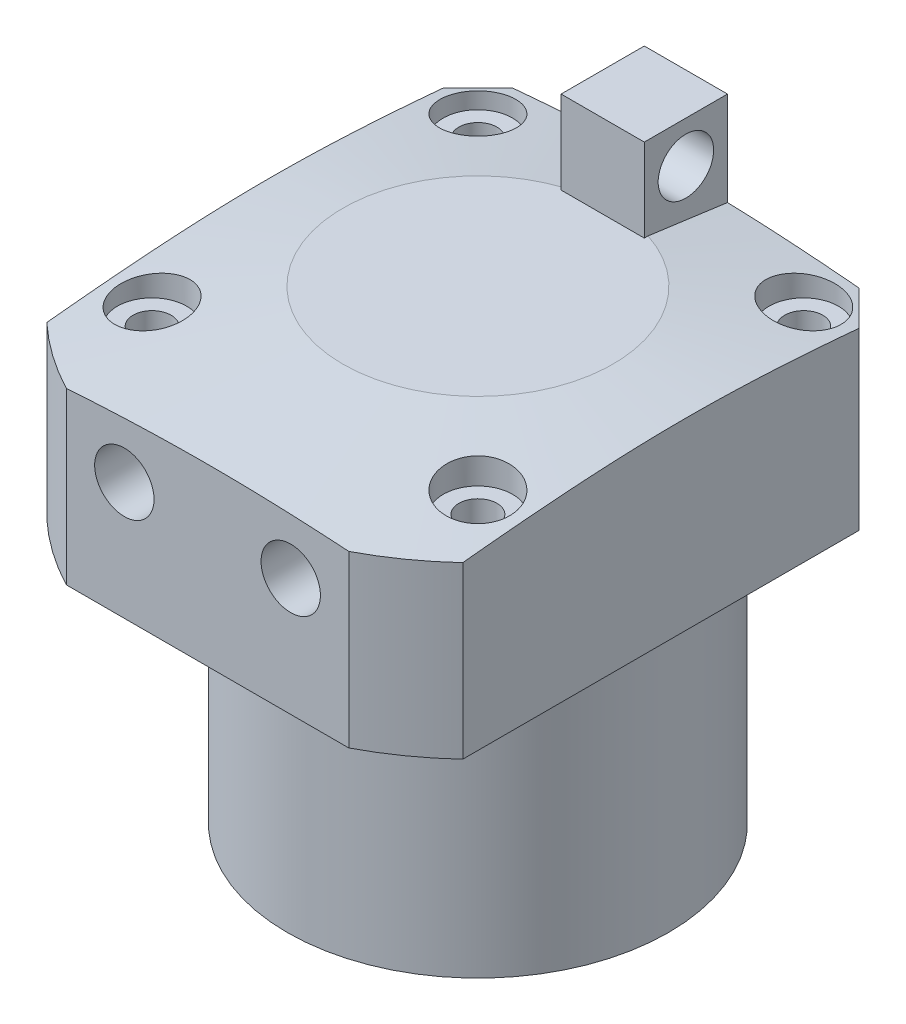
ISO-10303-21;
HEADER;
FILE_DESCRIPTION(('STEP AP214'),'2;1');
FILE_NAME('part.step','',(''),(''),'','','');
FILE_SCHEMA(('AUTOMOTIVE_DESIGN { 1 0 10303 214 1 1 1 1 }'));
ENDSEC;
DATA;
#1=APPLICATION_CONTEXT('core data for automotive mechanical design processes');
#2=APPLICATION_PROTOCOL_DEFINITION('international standard','automotive_design',2000,#1);
#3=PRODUCT_CONTEXT('',#1,'mechanical');
#4=PRODUCT('Part','Part','',(#3));
#5=PRODUCT_RELATED_PRODUCT_CATEGORY('part','',(#4));
#6=PRODUCT_DEFINITION_FORMATION('','',#4);
#7=PRODUCT_DEFINITION_CONTEXT('part definition',#1,'design');
#8=PRODUCT_DEFINITION('design','',#6,#7);
#9=PRODUCT_DEFINITION_SHAPE('','',#8);
#10=(LENGTH_UNIT() NAMED_UNIT(*) SI_UNIT(.MILLI.,.METRE.));
#11=(NAMED_UNIT(*) PLANE_ANGLE_UNIT() SI_UNIT($,.RADIAN.));
#12=(NAMED_UNIT(*) SI_UNIT($,.STERADIAN.) SOLID_ANGLE_UNIT());
#13=UNCERTAINTY_MEASURE_WITH_UNIT(LENGTH_MEASURE(1.E-05),#10,'distance_accuracy_value','');
#14=(GEOMETRIC_REPRESENTATION_CONTEXT(3) GLOBAL_UNCERTAINTY_ASSIGNED_CONTEXT((#13)) GLOBAL_UNIT_ASSIGNED_CONTEXT((#10,
#11,#12)) REPRESENTATION_CONTEXT('',''));
#15=CARTESIAN_POINT('',(0.,0.,0.));
#16=DIRECTION('',(0.,0.,1.));
#17=DIRECTION('',(1.,0.,0.));
#18=AXIS2_PLACEMENT_3D('',#15,#16,#17);
#19=CARTESIAN_POINT('',(-27.5,39.,0.));
#20=DIRECTION('',(0.,-1.,0.));
#21=DIRECTION('',(0.,0.,-1.));
#22=AXIS2_PLACEMENT_3D('',#19,#20,#21);
#23=PLANE('',#22);
#24=CARTESIAN_POINT('',(-23.5,39.,23.5));
#25=DIRECTION('',(0.,1.,0.));
#26=DIRECTION('',(0.,0.,1.));
#27=AXIS2_PLACEMENT_3D('',#24,#25,#26);
#28=CIRCLE('',#27,2.77499999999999);
#29=CARTESIAN_POINT('',(-23.5,39.,26.275));
#30=VERTEX_POINT('',#29);
#31=EDGE_CURVE('E181',#30,#30,#28,.T.);
#32=ORIENTED_EDGE('',*,*,#31,.T.);
#33=EDGE_LOOP('',(#32));
#34=FACE_BOUND('',#33,.T.);
#35=CARTESIAN_POINT('',(-23.5,39.,-23.5));
#36=DIRECTION('',(0.,1.,0.));
#37=DIRECTION('',(0.,0.,1.));
#38=AXIS2_PLACEMENT_3D('',#35,#36,#37);
#39=CIRCLE('',#38,2.77499999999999);
#40=CARTESIAN_POINT('',(-23.5,39.,-20.725));
#41=VERTEX_POINT('',#40);
#42=EDGE_CURVE('E511',#41,#41,#39,.T.);
#43=ORIENTED_EDGE('',*,*,#42,.T.);
#44=EDGE_LOOP('',(#43));
#45=FACE_BOUND('',#44,.T.);
#46=CARTESIAN_POINT('',(23.5,39.,-23.5));
#47=DIRECTION('',(0.,1.,0.));
#48=DIRECTION('',(0.,0.,1.));
#49=AXIS2_PLACEMENT_3D('',#46,#47,#48);
#50=CIRCLE('',#49,2.77499999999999);
#51=CARTESIAN_POINT('',(23.5,39.,-20.725));
#52=VERTEX_POINT('',#51);
#53=EDGE_CURVE('E299',#52,#52,#50,.T.);
#54=ORIENTED_EDGE('',*,*,#53,.T.);
#55=EDGE_LOOP('',(#54));
#56=FACE_BOUND('',#55,.T.);
#57=CARTESIAN_POINT('',(23.5,39.,23.5));
#58=DIRECTION('',(0.,1.,0.));
#59=DIRECTION('',(0.,0.,1.));
#60=AXIS2_PLACEMENT_3D('',#57,#58,#59);
#61=CIRCLE('',#60,2.77499999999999);
#62=CARTESIAN_POINT('',(23.5,39.,26.275));
#63=VERTEX_POINT('',#62);
#64=EDGE_CURVE('E489',#63,#63,#61,.T.);
#65=ORIENTED_EDGE('',*,*,#64,.T.);
#66=EDGE_LOOP('',(#65));
#67=FACE_BOUND('',#66,.T.);
#68=CARTESIAN_POINT('',(-12.,39.,33.5));
#69=DIRECTION('',(0.,-1.,0.));
#70=DIRECTION('',(0.,0.,-1.));
#71=AXIS2_PLACEMENT_3D('',#68,#69,#70);
#72=CIRCLE('',#71,3.99999999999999);
#73=CARTESIAN_POINT('',(-12.,39.,29.5));
#74=VERTEX_POINT('',#73);
#75=EDGE_CURVE('E477',#74,#74,#72,.T.);
#76=ORIENTED_EDGE('',*,*,#75,.F.);
#77=EDGE_LOOP('',(#76));
#78=FACE_BOUND('',#77,.T.);
#79=CARTESIAN_POINT('',(12.,39.,33.5));
#80=DIRECTION('',(0.,-1.,0.));
#81=DIRECTION('',(0.,0.,-1.));
#82=AXIS2_PLACEMENT_3D('',#79,#80,#81);
#83=CIRCLE('',#82,3.99999999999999);
#84=CARTESIAN_POINT('',(12.,39.,29.5));
#85=VERTEX_POINT('',#84);
#86=EDGE_CURVE('E471',#85,#85,#83,.T.);
#87=ORIENTED_EDGE('',*,*,#86,.F.);
#88=EDGE_LOOP('',(#87));
#89=FACE_BOUND('',#88,.T.);
#90=CARTESIAN_POINT('',(0.,39.,0.));
#91=DIRECTION('',(0.,1.,0.));
#92=DIRECTION('',(0.,0.,1.));
#93=AXIS2_PLACEMENT_3D('',#90,#91,#92);
#94=CIRCLE('',#93,27.5);
#95=CARTESIAN_POINT('',(0.,39.,27.5));
#96=VERTEX_POINT('',#95);
#97=EDGE_CURVE('E425',#96,#96,#94,.T.);
#98=ORIENTED_EDGE('',*,*,#97,.T.);
#99=EDGE_LOOP('',(#98));
#100=FACE_BOUND('',#99,.T.);
#101=DIRECTION('',(1.,0.,0.));
#102=VECTOR('',#101,1.);
#103=CARTESIAN_POINT('',(-27.5,39.,-30.));
#104=LINE('',#103,#102);
#105=CARTESIAN_POINT('',(-25.,39.,-30.));
#106=VERTEX_POINT('',#105);
#107=CARTESIAN_POINT('',(25.,39.,-30.));
#108=VERTEX_POINT('',#107);
#109=EDGE_CURVE('E453',#106,#108,#104,.T.);
#110=ORIENTED_EDGE('',*,*,#109,.T.);
#111=DIRECTION('',(-0.707106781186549,0.,-0.707106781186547));
#112=VECTOR('',#111,1.);
#113=CARTESIAN_POINT('',(13.7499999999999,39.,-41.25));
#114=LINE('',#113,#112);
#115=CARTESIAN_POINT('',(30.,39.,-25.));
#116=VERTEX_POINT('',#115);
#117=EDGE_CURVE('E47',#108,#116,#114,.F.);
#118=ORIENTED_EDGE('',*,*,#117,.T.);
#119=DIRECTION('',(0.,0.,1.));
#120=VECTOR('',#119,1.);
#121=CARTESIAN_POINT('',(30.,39.,0.));
#122=LINE('',#121,#120);
#123=CARTESIAN_POINT('',(30.,39.,32.1869538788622));
#124=VERTEX_POINT('',#123);
#125=EDGE_CURVE('E402',#116,#124,#122,.T.);
#126=ORIENTED_EDGE('',*,*,#125,.T.);
#127=CARTESIAN_POINT('',(0.,39.,0.));
#128=DIRECTION('',(0.,1.,0.));
#129=DIRECTION('',(0.,0.,1.));
#130=AXIS2_PLACEMENT_3D('',#127,#128,#129);
#131=CIRCLE('',#130,44.);
#132=CARTESIAN_POINT('',(20.3715487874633,39.,39.));
#133=VERTEX_POINT('',#132);
#134=EDGE_CURVE('E428',#133,#124,#131,.T.);
#135=ORIENTED_EDGE('',*,*,#134,.F.);
#136=DIRECTION('',(-1.,0.,0.));
#137=VECTOR('',#136,1.);
#138=CARTESIAN_POINT('',(-27.5,39.,39.));
#139=LINE('',#138,#137);
#140=CARTESIAN_POINT('',(-20.3715487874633,39.,39.));
#141=VERTEX_POINT('',#140);
#142=EDGE_CURVE('E438',#133,#141,#139,.T.);
#143=ORIENTED_EDGE('',*,*,#142,.T.);
#144=CARTESIAN_POINT('',(-30.,39.,32.1869538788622));
#145=VERTEX_POINT('',#144);
#146=EDGE_CURVE('E432',#145,#141,#131,.T.);
#147=ORIENTED_EDGE('',*,*,#146,.F.);
#148=DIRECTION('',(0.,0.,-1.));
#149=VECTOR('',#148,1.);
#150=CARTESIAN_POINT('',(-30.,39.,0.));
#151=LINE('',#150,#149);
#152=CARTESIAN_POINT('',(-30.,39.,-25.));
#153=VERTEX_POINT('',#152);
#154=EDGE_CURVE('E447',#145,#153,#151,.T.);
#155=ORIENTED_EDGE('',*,*,#154,.T.);
#156=DIRECTION('',(-0.707106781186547,0.,0.707106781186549));
#157=VECTOR('',#156,1.);
#158=CARTESIAN_POINT('',(-41.25,39.,-13.75));
#159=LINE('',#158,#157);
#160=EDGE_CURVE('E816',#153,#106,#159,.F.);
#161=ORIENTED_EDGE('',*,*,#160,.T.);
#162=EDGE_LOOP('',(#110,#118,#126,#135,#143,#147,#155,#161));
#163=FACE_BOUND('',#162,.T.);
#164=ADVANCED_FACE('F33',(#34,#45,#56,#67,#78,#89,#100,#163),#23,.T.);
#165=CARTESIAN_POINT('',(0.,87.0508296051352,0.));
#166=DIRECTION('',(0.,1.,0.));
#167=DIRECTION('',(0.,0.,1.));
#168=AXIS2_PLACEMENT_3D('',#165,#166,#167);
#169=CYLINDRICAL_SURFACE('',#168,44.);
#170=ORIENTED_EDGE('',*,*,#134,.T.);
#171=DIRECTION('',(0.,1.,0.));
#172=VECTOR('',#171,1.);
#173=CARTESIAN_POINT('',(30.,87.0508296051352,32.1869538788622));
#174=LINE('',#173,#172);
#175=CARTESIAN_POINT('',(30.,63.5549883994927,32.1869538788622));
#176=VERTEX_POINT('',#175);
#177=EDGE_CURVE('E407',#124,#176,#174,.T.);
#178=ORIENTED_EDGE('',*,*,#177,.T.);
#179=CARTESIAN_POINT('',(0.,63.5549883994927,0.));
#180=DIRECTION('',(0.,1.,0.));
#181=DIRECTION('',(0.,0.,1.));
#182=AXIS2_PLACEMENT_3D('',#179,#180,#181);
#183=CIRCLE('',#182,44.);
#184=CARTESIAN_POINT('',(20.3715487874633,63.5549883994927,39.));
#185=VERTEX_POINT('',#184);
#186=EDGE_CURVE('E433',#185,#176,#183,.T.);
#187=ORIENTED_EDGE('',*,*,#186,.F.);
#188=DIRECTION('',(0.,1.,0.));
#189=VECTOR('',#188,1.);
#190=CARTESIAN_POINT('',(20.3715487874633,87.0508296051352,39.));
#191=LINE('',#190,#189);
#192=EDGE_CURVE('E441',#185,#133,#191,.F.);
#193=ORIENTED_EDGE('',*,*,#192,.T.);
#194=EDGE_LOOP('',(#170,#178,#187,#193));
#195=FACE_BOUND('',#194,.T.);
#196=ADVANCED_FACE('F206',(#195),#169,.T.);
#197=ORIENTED_EDGE('',*,*,#146,.T.);
#198=DIRECTION('',(0.,1.,0.));
#199=VECTOR('',#198,1.);
#200=CARTESIAN_POINT('',(-20.3715487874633,87.0508296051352,39.));
#201=LINE('',#200,#199);
#202=CARTESIAN_POINT('',(-20.3715487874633,63.5549883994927,39.));
#203=VERTEX_POINT('',#202);
#204=EDGE_CURVE('E444',#141,#203,#201,.T.);
#205=ORIENTED_EDGE('',*,*,#204,.T.);
#206=CARTESIAN_POINT('',(-30.,63.5549883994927,32.1869538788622));
#207=VERTEX_POINT('',#206);
#208=EDGE_CURVE('E435',#207,#203,#183,.T.);
#209=ORIENTED_EDGE('',*,*,#208,.F.);
#210=DIRECTION('',(0.,1.,0.));
#211=VECTOR('',#210,1.);
#212=CARTESIAN_POINT('',(-30.,87.0508296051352,32.1869538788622));
#213=LINE('',#212,#211);
#214=EDGE_CURVE('E450',#207,#145,#213,.F.);
#215=ORIENTED_EDGE('',*,*,#214,.T.);
#216=EDGE_LOOP('',(#197,#205,#209,#215));
#217=FACE_BOUND('',#216,.T.);
#218=ADVANCED_FACE('F212',(#217),#169,.T.);
#219=CARTESIAN_POINT('',(0.,67.,0.));
#220=DIRECTION('',(0.,-1.,0.));
#221=DIRECTION('',(0.,0.,-1.));
#222=AXIS2_PLACEMENT_3D('',#219,#220,#221);
#223=CONICAL_SURFACE('',#222,19.4874687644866,1.43116998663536);
#224=CARTESIAN_POINT('',(-6.,68.6593883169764,-4.79448864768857));
#225=CARTESIAN_POINT('',(-6.,68.6312415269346,-5.11499366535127));
#226=CARTESIAN_POINT('',(-6.,68.6014420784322,-5.43534759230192));
#227=CARTESIAN_POINT('',(-6.,68.5391483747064,-6.07578575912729));
#228=CARTESIAN_POINT('',(-6.,68.5066541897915,-6.39587000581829));
#229=CARTESIAN_POINT('',(-6.,68.4395824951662,-7.03579413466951));
#230=CARTESIAN_POINT('',(-6.,68.4050051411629,-7.35563403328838));
#231=CARTESIAN_POINT('',(-6.,68.3341961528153,-7.9951325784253));
#232=CARTESIAN_POINT('',(-6.,68.2979645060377,-8.3147912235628));
#233=CARTESIAN_POINT('',(-6.,68.1873306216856,-9.27346986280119));
#234=CARTESIAN_POINT('',(-6.,68.1109816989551,-9.91226478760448));
#235=CARTESIAN_POINT('',(-6.,67.9549393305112,-11.1894577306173));
#236=CARTESIAN_POINT('',(-6.,67.8752458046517,-11.8278557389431));
#237=CARTESIAN_POINT('',(-6.,67.7094775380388,-13.1368652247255));
#238=CARTESIAN_POINT('',(-6.,67.6232845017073,-13.8074616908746));
#239=CARTESIAN_POINT('',(-6.,67.4491796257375,-15.1484314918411));
#240=CARTESIAN_POINT('',(-6.,67.3612677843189,-15.8188048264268));
#241=CARTESIAN_POINT('',(-6.,67.1842182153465,-17.1593844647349));
#242=CARTESIAN_POINT('',(-6.,67.0950804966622,-17.8295907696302));
#243=CARTESIAN_POINT('',(-6.,66.915901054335,-19.1698825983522));
#244=CARTESIAN_POINT('',(-6.,66.8258593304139,-19.8399681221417));
#245=CARTESIAN_POINT('',(-6.,66.554707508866,-21.8502270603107));
#246=CARTESIAN_POINT('',(-6.,66.3725891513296,-23.1902644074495));
#247=CARTESIAN_POINT('',(-6.,66.0067350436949,-25.8701187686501));
#248=CARTESIAN_POINT('',(-6.,65.8229992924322,-27.2099357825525));
#249=CARTESIAN_POINT('',(-6.,65.3668322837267,-30.5266857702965));
#250=CARTESIAN_POINT('',(-6.,65.0937826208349,-32.5035336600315));
#251=CARTESIAN_POINT('',(-6.,64.5463692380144,-36.4570468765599));
#252=CARTESIAN_POINT('',(-6.,64.2720055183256,-38.4337122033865));
#253=CARTESIAN_POINT('',(-6.,63.7224937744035,-42.3865743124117));
#254=CARTESIAN_POINT('',(-6.,63.447345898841,-44.3627711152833));
#255=CARTESIAN_POINT('',(-6.,62.8964710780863,-48.3150838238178));
#256=CARTESIAN_POINT('',(-6.,62.6207441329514,-50.2911997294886));
#257=CARTESIAN_POINT('',(-6.,62.3448546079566,-52.267292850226));
#258=B_SPLINE_CURVE_WITH_KNOTS('',3,(#224,#225,#226,#227,#228,#229,#230,#231,#232,#233,#234,
#235,#236,#237,#238,#239,#240,#241,#242,#243,#244,#245,#246,#247,#248,#249,#250,#251,#252,#253,
#254,#255,#256,#257),.UNSPECIFIED.,.F.,.F.,(4,2,2,2,2,2,2,2,2,2,2,2,2,2,2,2,4),(0.,
0.965202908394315,1.93038064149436,2.89548632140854,3.86059925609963,5.79060721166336,
7.72066144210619,9.74899716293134,11.7773349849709,13.8056581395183,15.8339819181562,
19.8910484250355,23.9481178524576,29.9349652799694,35.9218116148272,41.9075897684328,
47.8933673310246),.UNSPECIFIED.);
#259=CARTESIAN_POINT('',(-6.,67.,-18.5408046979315));
#260=VERTEX_POINT('',#259);
#261=CARTESIAN_POINT('',(-6.,65.4390623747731,-30.));
#262=VERTEX_POINT('',#261);
#263=EDGE_CURVE('E173',#260,#262,#258,.T.);
#264=ORIENTED_EDGE('',*,*,#263,.T.);
#265=CARTESIAN_POINT('',(-59.8590175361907,60.3287371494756,-30.));
#266=CARTESIAN_POINT('',(-58.3010970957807,60.5244490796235,-30.));
#267=CARTESIAN_POINT('',(-56.7429926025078,60.7187112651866,-30.));
#268=CARTESIAN_POINT('',(-53.6263221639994,61.1035592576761,-30.));
#269=CARTESIAN_POINT('',(-52.0677562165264,61.2941450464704,-30.));
#270=CARTESIAN_POINT('',(-48.9501343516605,61.6708554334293,-30.));
#271=CARTESIAN_POINT('',(-47.3910784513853,61.8569801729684,-30.));
#272=CARTESIAN_POINT('',(-44.272318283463,62.2237157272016,-30.));
#273=CARTESIAN_POINT('',(-42.7126140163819,62.4043265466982,-30.));
#274=CARTESIAN_POINT('',(-39.5946178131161,62.7584298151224,-30.));
#275=CARTESIAN_POINT('',(-38.0363269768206,62.9319319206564,-30.));
#276=CARTESIAN_POINT('',(-34.9188064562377,63.2703297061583,-30.));
#277=CARTESIAN_POINT('',(-33.359576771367,63.4352253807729,-30.));
#278=CARTESIAN_POINT('',(-30.2397798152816,63.7541578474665,-30.));
#279=CARTESIAN_POINT('',(-28.6792123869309,63.9081931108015,-30.));
#280=CARTESIAN_POINT('',(-25.5567651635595,64.2024632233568,-30.));
#281=CARTESIAN_POINT('',(-23.9948853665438,64.3426980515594,-30.));
#282=CARTESIAN_POINT('',(-20.8645037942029,64.6061546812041,-30.));
#283=CARTESIAN_POINT('',(-19.2959971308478,64.7293190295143,-30.));
#284=CARTESIAN_POINT('',(-16.1573987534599,64.9537112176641,-30.));
#285=CARTESIAN_POINT('',(-14.5873070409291,65.05493907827,-30.));
#286=CARTESIAN_POINT('',(-11.4460825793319,65.2306402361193,-30.));
#287=CARTESIAN_POINT('',(-9.87495031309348,65.3051219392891,-30.));
#288=CARTESIAN_POINT('',(-7.5173896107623,65.3935129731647,-30.));
#289=CARTESIAN_POINT('',(-6.73138951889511,65.4190881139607,-30.));
#290=CARTESIAN_POINT('',(-5.15916715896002,65.4620399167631,-30.));
#291=CARTESIAN_POINT('',(-4.37294489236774,65.4794166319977,-30.));
#292=CARTESIAN_POINT('',(-2.79950332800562,65.5056673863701,-30.));
#293=CARTESIAN_POINT('',(-2.01228387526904,65.5145321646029,-30.));
#294=CARTESIAN_POINT('',(-0.437794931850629,65.5235605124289,-30.));
#295=CARTESIAN_POINT('',(0.349474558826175,65.523724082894,-30.));
#296=CARTESIAN_POINT('',(1.92396875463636,65.5153449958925,-30.));
#297=CARTESIAN_POINT('',(2.71119345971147,65.5068023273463,-30.));
#298=CARTESIAN_POINT('',(4.2854999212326,65.4811781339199,-30.));
#299=CARTESIAN_POINT('',(5.07258167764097,65.4640966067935,-30.));
#300=CARTESIAN_POINT('',(7.43393142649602,65.4004644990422,-30.));
#301=CARTESIAN_POINT('',(9.00788258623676,65.3415289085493,-30.));
#302=CARTESIAN_POINT('',(11.3677326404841,65.2312292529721,-30.));
#303=CARTESIAN_POINT('',(12.1541728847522,65.1908131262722,-30.));
#304=CARTESIAN_POINT('',(13.726682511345,65.1032779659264,-30.));
#305=CARTESIAN_POINT('',(14.5127518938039,65.056158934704,-30.));
#306=CARTESIAN_POINT('',(16.4291931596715,64.9338022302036,-30.));
#307=CARTESIAN_POINT('',(17.5593560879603,64.8552961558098,-30.));
#308=CARTESIAN_POINT('',(19.8188736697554,64.6873868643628,-30.));
#309=CARTESIAN_POINT('',(20.9482283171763,64.5979835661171,-30.));
#310=CARTESIAN_POINT('',(23.2062130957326,64.4098937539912,-30.));
#311=CARTESIAN_POINT('',(24.3348431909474,64.3112068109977,-30.));
#312=CARTESIAN_POINT('',(26.5913831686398,64.1059867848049,-30.));
#313=CARTESIAN_POINT('',(27.7192930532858,63.9994537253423,-30.));
#314=CARTESIAN_POINT('',(29.9746698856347,63.7797542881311,-30.));
#315=CARTESIAN_POINT('',(31.1021367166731,63.6665867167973,-30.));
#316=CARTESIAN_POINT('',(33.3564959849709,63.4346769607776,-30.));
#317=CARTESIAN_POINT('',(34.4833884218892,63.3159347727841,-30.));
#318=CARTESIAN_POINT('',(36.736641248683,63.0737498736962,-30.));
#319=CARTESIAN_POINT('',(37.8630016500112,62.950307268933,-30.));
#320=CARTESIAN_POINT('',(40.1152789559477,62.6994358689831,-30.));
#321=CARTESIAN_POINT('',(41.2411958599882,62.5720070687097,-30.));
#322=CARTESIAN_POINT('',(44.6198896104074,62.1844925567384,-30.));
#323=CARTESIAN_POINT('',(46.8720858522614,61.9193442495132,-30.));
#324=CARTESIAN_POINT('',(51.3752995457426,61.379205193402,-30.));
#325=CARTESIAN_POINT('',(53.6263169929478,61.1042144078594,-30.));
#326=CARTESIAN_POINT('',(58.1271955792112,60.5469004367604,-30.));
#327=CARTESIAN_POINT('',(60.3770568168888,60.2645780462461,-30.));
#328=CARTESIAN_POINT('',(64.8760647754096,59.6943319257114,-30.));
#329=CARTESIAN_POINT('',(67.1252114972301,59.4064082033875,-30.));
#330=CARTESIAN_POINT('',(71.6188397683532,58.8267462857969,-30.));
#331=CARTESIAN_POINT('',(73.8633223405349,58.5350160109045,-30.));
#332=CARTESIAN_POINT('',(78.3518414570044,57.9481425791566,-30.));
#333=CARTESIAN_POINT('',(80.595878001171,57.6529994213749,-30.));
#334=CARTESIAN_POINT('',(85.0836641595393,57.0599714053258,-30.));
#335=CARTESIAN_POINT('',(87.3274137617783,56.7620864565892,-30.));
#336=CARTESIAN_POINT('',(91.8146175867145,56.1640997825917,-30.));
#337=CARTESIAN_POINT('',(94.0580718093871,55.8639980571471,-30.));
#338=CARTESIAN_POINT('',(98.5415125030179,55.2624065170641,-30.));
#339=CARTESIAN_POINT('',(100.781499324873,54.9609193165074,-30.));
#340=CARTESIAN_POINT('',(105.261269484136,54.3564363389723,-30.));
#341=CARTESIAN_POINT('',(107.501052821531,54.0534405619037,-30.));
#342=CARTESIAN_POINT('',(111.980366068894,53.4461964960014,-30.));
#343=CARTESIAN_POINT('',(114.219895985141,53.14194825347,-30.));
#344=CARTESIAN_POINT('',(118.698808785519,52.5323744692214,-30.));
#345=CARTESIAN_POINT('',(120.938191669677,52.2270489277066,-30.));
#346=CARTESIAN_POINT('',(123.177513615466,51.9212778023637,-30.));
#347=B_SPLINE_CURVE_WITH_KNOTS('',3,(#265,#266,#267,#268,#269,#270,#271,#272,#273,#274,#275,
#276,#277,#278,#279,#280,#281,#282,#283,#284,#285,#286,#287,#288,#289,#290,#291,#292,#293,#294,
#295,#296,#297,#298,#299,#300,#301,#302,#303,#304,#305,#306,#307,#308,#309,#310,#311,#312,#313,
#314,#315,#316,#317,#318,#319,#320,#321,#322,#323,#324,#325,#326,#327,#328,#329,#330,#331,#332,
#333,#334,#335,#336,#337,#338,#339,#340,#341,#342,#343,#344,#345,#346),.UNSPECIFIED.,.F.,.F.,(4,
2,2,2,2,2,2,2,2,2,2,2,2,2,2,2,2,2,2,2,2,2,2,2,2,2,2,2,2,2,2,2,2,2,2,2,2,2,2,2,4),(0.,
4.71049826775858,9.42101976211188,14.1313917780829,18.8417596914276,23.5455011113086,
28.2492454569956,32.95365059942,37.6580629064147,42.3779428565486,47.0978183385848,
51.8162091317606,54.1754213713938,56.5346182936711,58.8963791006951,61.2581396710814,
63.6199032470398,65.9816674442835,70.7064595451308,73.0688736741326,75.4312869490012,
78.8298813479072,82.2285010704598,85.6272779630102,89.0260445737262,92.4254245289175,
95.824806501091,99.224111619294,102.623421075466,109.426637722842,116.229879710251,
123.032387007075,129.834884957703,136.624968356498,143.415053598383,150.205363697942,
156.995674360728,163.776228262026,170.556782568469,177.337088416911,184.117392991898),.UNSPECIFIED.);
#348=CARTESIAN_POINT('',(-25.,64.2504900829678,-30.));
#349=VERTEX_POINT('',#348);
#350=EDGE_CURVE('E421',#262,#349,#347,.F.);
#351=ORIENTED_EDGE('',*,*,#350,.T.);
#352=CARTESIAN_POINT('',(-25.,64.2504900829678,-30.));
#353=CARTESIAN_POINT('',(-25.8333333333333,64.2655162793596,-29.1666666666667));
#354=CARTESIAN_POINT('',(-26.6666666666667,64.2730293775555,-28.3333333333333));
#355=CARTESIAN_POINT('',(-28.3333333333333,64.2730293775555,-26.6666666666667));
#356=CARTESIAN_POINT('',(-29.1666666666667,64.2655162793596,-25.8333333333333));
#357=CARTESIAN_POINT('',(-30.,64.2504900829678,-25.));
#358=B_SPLINE_CURVE_WITH_KNOTS('',3,(#352,#353,#354,#355,#356,#357),.UNSPECIFIED.,.F.,.F.,(4,2,
4),(0.,3.53560575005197,7.07121150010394),.UNSPECIFIED.);
#359=CARTESIAN_POINT('',(-30.,64.2504900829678,-25.));
#360=VERTEX_POINT('',#359);
#361=EDGE_CURVE('E240',#349,#360,#358,.T.);
#362=ORIENTED_EDGE('',*,*,#361,.T.);
#363=CARTESIAN_POINT('',(-30.,59.6820627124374,-64.9649668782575));
#364=CARTESIAN_POINT('',(-30.,59.8911886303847,-63.3257323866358));
#365=CARTESIAN_POINT('',(-30.,60.0990011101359,-61.6863288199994));
#366=CARTESIAN_POINT('',(-30.,60.5112927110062,-58.4070966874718));
#367=CARTESIAN_POINT('',(-30.,60.715771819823,-56.7672681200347));
#368=CARTESIAN_POINT('',(-30.,61.1206687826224,-53.4872721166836));
#369=CARTESIAN_POINT('',(-30.,61.3210870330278,-51.8471047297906));
#370=CARTESIAN_POINT('',(-30.,61.7169147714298,-48.56616566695));
#371=CARTESIAN_POINT('',(-30.,61.9123242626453,-46.9253939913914));
#372=CARTESIAN_POINT('',(-30.,62.2966603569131,-43.6450437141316));
#373=CARTESIAN_POINT('',(-30.,62.4855943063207,-42.0054659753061));
#374=CARTESIAN_POINT('',(-30.,62.8555829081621,-38.7254178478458));
#375=CARTESIAN_POINT('',(-30.,63.0366375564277,-37.0849474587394));
#376=CARTESIAN_POINT('',(-30.,63.3887449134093,-33.802632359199));
#377=CARTESIAN_POINT('',(-30.,63.5597958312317,-32.1607874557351));
#378=CARTESIAN_POINT('',(-30.,63.8890348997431,-28.8757980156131));
#379=CARTESIAN_POINT('',(-30.,64.0472230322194,-27.2326534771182));
#380=CARTESIAN_POINT('',(-30.,64.3475709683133,-23.9395280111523));
#381=CARTESIAN_POINT('',(-30.,64.4896772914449,-22.2895421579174));
#382=CARTESIAN_POINT('',(-30.,64.7526753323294,-18.987861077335));
#383=CARTESIAN_POINT('',(-30.,64.8735670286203,-17.3361658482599));
#384=CARTESIAN_POINT('',(-30.,65.088717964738,-14.0315921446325));
#385=CARTESIAN_POINT('',(-30.,65.1829867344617,-12.378714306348));
#386=CARTESIAN_POINT('',(-30.,65.3003442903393,-9.89826851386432));
#387=CARTESIAN_POINT('',(-30.,65.3354559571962,-9.07126216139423));
#388=CARTESIAN_POINT('',(-30.,65.3970626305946,-7.41693069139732));
#389=CARTESIAN_POINT('',(-30.,65.4235576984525,-6.58960557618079));
#390=CARTESIAN_POINT('',(-30.,65.4674522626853,-4.93378625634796));
#391=CARTESIAN_POINT('',(-30.,65.4848415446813,-4.10529177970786));
#392=CARTESIAN_POINT('',(-30.,65.5101285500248,-2.44815708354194));
#393=CARTESIAN_POINT('',(-30.,65.5180262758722,-1.61951686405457));
#394=CARTESIAN_POINT('',(-30.,65.5241643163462,0.037796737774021));
#395=CARTESIAN_POINT('',(-30.,65.522404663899,0.866470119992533));
#396=CARTESIAN_POINT('',(-30.,65.5092653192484,2.523740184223));
#397=CARTESIAN_POINT('',(-30.,65.4978856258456,3.35233686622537));
#398=CARTESIAN_POINT('',(-30.,65.465737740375,5.00959171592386));
#399=CARTESIAN_POINT('',(-30.,65.4449667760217,5.83824982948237));
#400=CARTESIAN_POINT('',(-30.,65.3944472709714,7.4952928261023));
#401=CARTESIAN_POINT('',(-30.,65.3646987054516,8.32367770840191));
#402=CARTESIAN_POINT('',(-30.,65.2967727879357,9.98009463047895));
#403=CARTESIAN_POINT('',(-30.,65.2585954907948,10.8081266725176));
#404=CARTESIAN_POINT('',(-30.,65.174451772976,12.4637902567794));
#405=CARTESIAN_POINT('',(-30.,65.1284853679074,13.2914217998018));
#406=CARTESIAN_POINT('',(-30.,65.0012470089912,15.4175333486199));
#407=CARTESIAN_POINT('',(-30.,64.9147780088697,16.715703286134));
#408=CARTESIAN_POINT('',(-30.,64.7270202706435,19.3109784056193));
#409=CARTESIAN_POINT('',(-30.,64.6257312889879,20.6080835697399));
#410=CARTESIAN_POINT('',(-30.,64.410811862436,23.201353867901));
#411=CARTESIAN_POINT('',(-30.,64.2971805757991,24.4975189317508));
#412=CARTESIAN_POINT('',(-30.,64.0597466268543,27.0889054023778));
#413=CARTESIAN_POINT('',(-30.,63.9359440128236,28.3841268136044));
#414=CARTESIAN_POINT('',(-30.,63.6799492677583,30.9740795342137));
#415=CARTESIAN_POINT('',(-30.,63.5477549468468,32.2688106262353));
#416=CARTESIAN_POINT('',(-30.,63.276496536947,34.8575516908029));
#417=CARTESIAN_POINT('',(-30.,63.1374324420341,36.1515616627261));
#418=CARTESIAN_POINT('',(-30.,62.853647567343,38.7389146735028));
#419=CARTESIAN_POINT('',(-30.,62.7089269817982,40.0322577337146));
#420=CARTESIAN_POINT('',(-30.,62.4147978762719,42.6184090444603));
#421=CARTESIAN_POINT('',(-30.,62.2653893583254,43.9112172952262));
#422=CARTESIAN_POINT('',(-30.,61.9625216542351,46.497638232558));
#423=CARTESIAN_POINT('',(-30.,61.8090586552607,47.7912504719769));
#424=CARTESIAN_POINT('',(-30.,61.4988516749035,50.3780818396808));
#425=CARTESIAN_POINT('',(-30.,61.3421076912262,51.6713009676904));
#426=CARTESIAN_POINT('',(-30.,60.8677490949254,55.5504671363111));
#427=CARTESIAN_POINT('',(-30.,60.5460093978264,58.1359097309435));
#428=CARTESIAN_POINT('',(-30.,59.8946375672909,63.3053873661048));
#429=CARTESIAN_POINT('',(-30.,59.5650066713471,65.8894225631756));
#430=CARTESIAN_POINT('',(-30.,58.8998299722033,71.0567251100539));
#431=CARTESIAN_POINT('',(-30.,58.5642841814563,73.6399924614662));
#432=CARTESIAN_POINT('',(-30.,57.8890402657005,78.8033259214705));
#433=CARTESIAN_POINT('',(-30.,57.5493466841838,81.3833926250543));
#434=CARTESIAN_POINT('',(-30.,56.866480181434,86.5430664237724));
#435=CARTESIAN_POINT('',(-30.,56.5233072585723,89.1226735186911));
#436=CARTESIAN_POINT('',(-30.,55.8341986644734,94.2816470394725));
#437=CARTESIAN_POINT('',(-30.,55.4882628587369,96.8610134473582));
#438=CARTESIAN_POINT('',(-30.,54.7941895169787,102.019450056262));
#439=CARTESIAN_POINT('',(-30.,54.4460519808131,104.59852025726));
#440=CARTESIAN_POINT('',(-30.,53.7486388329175,109.751603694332));
#441=CARTESIAN_POINT('',(-30.,53.3993665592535,112.325617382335));
#442=CARTESIAN_POINT('',(-30.,52.6993533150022,117.473445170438));
#443=CARTESIAN_POINT('',(-30.,52.3486123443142,120.047259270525));
#444=CARTESIAN_POINT('',(-30.,51.6459280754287,125.194586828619));
#445=CARTESIAN_POINT('',(-30.,51.2939848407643,127.768100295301));
#446=CARTESIAN_POINT('',(-30.,50.5890642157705,132.91498517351));
#447=CARTESIAN_POINT('',(-30.,50.2360868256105,135.48835658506));
#448=CARTESIAN_POINT('',(-30.,49.8826854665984,138.061669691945));
#449=B_SPLINE_CURVE_WITH_KNOTS('',3,(#363,#364,#365,#366,#367,#368,#369,#370,#371,#372,#373,
#374,#375,#376,#377,#378,#379,#380,#381,#382,#383,#384,#385,#386,#387,#388,#389,#390,#391,#392,
#393,#394,#395,#396,#397,#398,#399,#400,#401,#402,#403,#404,#405,#406,#407,#408,#409,#410,#411,
#412,#413,#414,#415,#416,#417,#418,#419,#420,#421,#422,#423,#424,#425,#426,#427,#428,#429,#430,
#431,#432,#433,#434,#435,#436,#437,#438,#439,#440,#441,#442,#443,#444,#445,#446,#447,#448),
.UNSPECIFIED.,.F.,.F.,(4,2,2,2,2,2,2,2,2,2,2,2,2,2,2,2,2,2,2,2,2,2,2,2,2,2,2,2,2,2,2,2,2,2,2,2,
2,2,2,2,2,2,4),(0.,4.95756263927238,9.91514357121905,14.8722381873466,19.8293296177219,
24.7805974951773,29.7318679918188,34.6840221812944,39.6361833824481,44.6043570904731,
49.572535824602,54.5389338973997,57.022150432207,59.5053492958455,61.9913277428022,
64.4773055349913,66.9632748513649,69.4492444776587,71.9359484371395,74.4226592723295,
76.9093539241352,79.3960435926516,83.2990733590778,87.2021672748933,91.1055275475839,
95.0088692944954,98.9132338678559,102.817601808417,106.721835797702,110.626068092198,
114.534112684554,118.442160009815,126.258294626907,134.073211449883,141.888111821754,
149.695107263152,157.502106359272,165.309487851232,173.116869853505,180.909676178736,
188.702483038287,196.494884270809,204.287284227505),.UNSPECIFIED.);
#450=EDGE_CURVE('E263',#360,#207,#449,.T.);
#451=ORIENTED_EDGE('',*,*,#450,.T.);
#452=ORIENTED_EDGE('',*,*,#208,.T.);
#453=CARTESIAN_POINT('',(-67.3367778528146,58.8025391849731,39.));
#454=CARTESIAN_POINT('',(-66.401074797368,58.916333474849,39.));
#455=CARTESIAN_POINT('',(-65.4653008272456,59.0295443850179,39.));
#456=CARTESIAN_POINT('',(-63.5935968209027,59.2546734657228,39.));
#457=CARTESIAN_POINT('',(-62.6576667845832,59.3665916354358,39.));
#458=CARTESIAN_POINT('',(-59.849608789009,59.7002195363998,39.));
#459=CARTESIAN_POINT('',(-57.9772271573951,59.9198009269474,39.));
#460=CARTESIAN_POINT('',(-54.231439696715,60.3520608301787,39.));
#461=CARTESIAN_POINT('',(-52.3580337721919,60.564738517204,39.));
#462=CARTESIAN_POINT('',(-48.6102730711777,60.9815621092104,39.));
#463=CARTESIAN_POINT('',(-46.735918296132,61.1857080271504,39.));
#464=CARTESIAN_POINT('',(-42.9895045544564,61.5830691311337,39.));
#465=CARTESIAN_POINT('',(-41.1174476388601,61.7763035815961,39.));
#466=CARTESIAN_POINT('',(-37.3720200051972,62.1496777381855,39.));
#467=CARTESIAN_POINT('',(-35.4986492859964,62.329817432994,39.));
#468=CARTESIAN_POINT('',(-31.7503064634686,62.6738057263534,39.));
#469=CARTESIAN_POINT('',(-29.875334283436,62.8376534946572,39.));
#470=CARTESIAN_POINT('',(-26.1237160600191,63.1451468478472,39.));
#471=CARTESIAN_POINT('',(-24.2470700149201,63.2887924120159,39.));
#472=CARTESIAN_POINT('',(-20.4859838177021,63.5517838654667,39.));
#473=CARTESIAN_POINT('',(-18.6015380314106,63.6710499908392,39.));
#474=CARTESIAN_POINT('',(-14.8309903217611,63.87979911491,39.));
#475=CARTESIAN_POINT('',(-12.9448884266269,63.9692826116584,39.));
#476=CARTESIAN_POINT('',(-10.1149519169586,64.077784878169,39.));
#477=CARTESIAN_POINT('',(-9.17160068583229,64.1096632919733,39.));
#478=CARTESIAN_POINT('',(-7.2846382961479,64.1644064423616,39.));
#479=CARTESIAN_POINT('',(-6.3410271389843,64.187271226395,39.));
#480=CARTESIAN_POINT('',(-4.45362555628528,64.2236345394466,39.));
#481=CARTESIAN_POINT('',(-3.50983513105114,64.2371330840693,39.));
#482=CARTESIAN_POINT('',(-1.62216418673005,64.2545502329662,39.));
#483=CARTESIAN_POINT('',(-0.678283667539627,64.2584688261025,39.));
#484=CARTESIAN_POINT('',(1.21045733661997,64.2566611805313,39.));
#485=CARTESIAN_POINT('',(2.15531781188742,64.250924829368,39.));
#486=CARTESIAN_POINT('',(4.04493611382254,64.2298813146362,39.));
#487=CARTESIAN_POINT('',(4.98969393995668,64.2145741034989,39.));
#488=CARTESIAN_POINT('',(6.87901067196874,64.174630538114,39.));
#489=CARTESIAN_POINT('',(7.82356957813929,64.1499941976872,39.));
#490=CARTESIAN_POINT('',(9.71241303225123,64.0917685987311,39.));
#491=CARTESIAN_POINT('',(10.6566975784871,64.0581792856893,39.));
#492=CARTESIAN_POINT('',(13.4894553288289,63.9446644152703,39.));
#493=CARTESIAN_POINT('',(15.3774314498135,63.8520007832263,39.));
#494=CARTESIAN_POINT('',(18.2080954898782,63.6909739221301,39.));
#495=CARTESIAN_POINT('',(19.1514362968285,63.6336261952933,39.));
#496=CARTESIAN_POINT('',(21.037687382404,63.5122040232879,39.));
#497=CARTESIAN_POINT('',(21.9805976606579,63.448129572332,39.));
#498=CARTESIAN_POINT('',(25.1835413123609,63.2200394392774,39.));
#499=CARTESIAN_POINT('',(27.442545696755,63.0415056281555,39.));
#500=CARTESIAN_POINT('',(31.9582273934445,62.6570038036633,39.));
#501=CARTESIAN_POINT('',(34.214904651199,62.4510351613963,39.));
#502=CARTESIAN_POINT('',(38.7264065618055,62.0179616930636,39.));
#503=CARTESIAN_POINT('',(40.9812310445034,61.7908551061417,39.));
#504=CARTESIAN_POINT('',(45.489157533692,61.3204177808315,39.));
#505=CARTESIAN_POINT('',(47.7422595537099,61.0770871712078,39.));
#506=CARTESIAN_POINT('',(52.2477581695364,60.577819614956,39.));
#507=CARTESIAN_POINT('',(54.5001543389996,60.3218788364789,39.));
#508=CARTESIAN_POINT('',(59.0038147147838,59.8002277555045,39.));
#509=CARTESIAN_POINT('',(61.2550789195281,59.5345174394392,39.));
#510=CARTESIAN_POINT('',(65.7565723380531,58.9954145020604,39.));
#511=CARTESIAN_POINT('',(68.0068015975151,58.7220222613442,39.));
#512=CARTESIAN_POINT('',(72.5065039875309,58.1691058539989,39.));
#513=CARTESIAN_POINT('',(74.7559771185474,57.8895816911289,39.));
#514=CARTESIAN_POINT('',(79.2482180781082,57.3263529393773,39.));
#515=CARTESIAN_POINT('',(81.4909875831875,57.0426617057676,39.));
#516=CARTESIAN_POINT('',(85.9760154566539,56.4712694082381,39.));
#517=CARTESIAN_POINT('',(88.2182738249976,56.1835683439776,39.));
#518=CARTESIAN_POINT('',(92.7023958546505,55.6048576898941,39.));
#519=CARTESIAN_POINT('',(94.9442595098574,55.3138480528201,39.));
#520=CARTESIAN_POINT('',(99.4276282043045,54.7290788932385,39.));
#521=CARTESIAN_POINT('',(101.669133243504,54.4353193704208,39.));
#522=CARTESIAN_POINT('',(106.149995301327,53.8457340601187,39.));
#523=CARTESIAN_POINT('',(108.389352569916,53.5499101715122,39.));
#524=CARTESIAN_POINT('',(112.867808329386,52.9563096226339,39.));
#525=CARTESIAN_POINT('',(115.106906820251,52.6585329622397,39.));
#526=CARTESIAN_POINT('',(119.584839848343,52.0613209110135,39.));
#527=CARTESIAN_POINT('',(121.823674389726,51.7618855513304,39.));
#528=CARTESIAN_POINT('',(126.301149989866,51.1615759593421,39.));
#529=CARTESIAN_POINT('',(128.539791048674,50.8607017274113,39.));
#530=CARTESIAN_POINT('',(130.778350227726,50.5592206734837,39.));
#531=B_SPLINE_CURVE_WITH_KNOTS('',3,(#453,#454,#455,#456,#457,#458,#459,#460,#461,#462,#463,
#464,#465,#466,#467,#468,#469,#470,#471,#472,#473,#474,#475,#476,#477,#478,#479,#480,#481,#482,
#483,#484,#485,#486,#487,#488,#489,#490,#491,#492,#493,#494,#495,#496,#497,#498,#499,#500,#501,
#502,#503,#504,#505,#506,#507,#508,#509,#510,#511,#512,#513,#514,#515,#516,#517,#518,#519,#520,
#521,#522,#523,#524,#525,#526,#527,#528,#529,#530),.UNSPECIFIED.,.F.,.F.,(4,2,2,2,2,2,2,2,2,2,2,
2,2,2,2,2,2,2,2,2,2,2,2,2,2,2,2,2,2,2,2,2,2,2,2,2,2,2,4),(0.,2.82779104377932,5.65558388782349,
11.3112125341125,16.9675150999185,22.6238090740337,28.2697826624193,33.9157611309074,
39.5620271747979,45.2082990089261,50.8727584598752,56.5371231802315,59.3687562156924,
62.2003743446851,65.0319877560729,67.8636044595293,70.698188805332,73.5327872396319,
76.3673814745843,79.2019929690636,84.87241965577,87.7076499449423,90.5428826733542,
97.3407807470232,104.138834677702,110.937455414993,117.736022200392,124.53666776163,
131.337322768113,138.137641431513,144.937955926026,151.719873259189,158.501791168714,
165.283806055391,172.065821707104,178.842257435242,185.618693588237,192.39500291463,
199.171310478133),.UNSPECIFIED.);
#532=EDGE_CURVE('E276',#203,#185,#531,.T.);
#533=ORIENTED_EDGE('',*,*,#532,.T.);
#534=ORIENTED_EDGE('',*,*,#186,.T.);
#535=CARTESIAN_POINT('',(30.,59.6820627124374,-64.9649668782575));
#536=CARTESIAN_POINT('',(30.,59.8911886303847,-63.3257323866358));
#537=CARTESIAN_POINT('',(30.,60.0990011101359,-61.6863288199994));
#538=CARTESIAN_POINT('',(30.,60.5112927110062,-58.4070966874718));
#539=CARTESIAN_POINT('',(30.,60.715771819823,-56.7672681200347));
#540=CARTESIAN_POINT('',(30.,61.1206687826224,-53.4872721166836));
#541=CARTESIAN_POINT('',(30.,61.3210870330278,-51.8471047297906));
#542=CARTESIAN_POINT('',(30.,61.7169147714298,-48.56616566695));
#543=CARTESIAN_POINT('',(30.,61.9123242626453,-46.9253939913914));
#544=CARTESIAN_POINT('',(30.,62.2966603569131,-43.6450437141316));
#545=CARTESIAN_POINT('',(30.,62.4855943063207,-42.0054659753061));
#546=CARTESIAN_POINT('',(30.,62.8555829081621,-38.7254178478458));
#547=CARTESIAN_POINT('',(30.,63.0366375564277,-37.0849474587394));
#548=CARTESIAN_POINT('',(30.,63.3887449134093,-33.802632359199));
#549=CARTESIAN_POINT('',(30.,63.5597958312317,-32.1607874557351));
#550=CARTESIAN_POINT('',(30.,63.8890348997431,-28.8757980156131));
#551=CARTESIAN_POINT('',(30.,64.0472230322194,-27.2326534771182));
#552=CARTESIAN_POINT('',(30.,64.3475709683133,-23.9395280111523));
#553=CARTESIAN_POINT('',(30.,64.4896772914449,-22.2895421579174));
#554=CARTESIAN_POINT('',(30.,64.7526753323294,-18.987861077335));
#555=CARTESIAN_POINT('',(30.,64.8735670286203,-17.3361658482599));
#556=CARTESIAN_POINT('',(30.,65.088717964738,-14.0315921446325));
#557=CARTESIAN_POINT('',(30.,65.1829867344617,-12.378714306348));
#558=CARTESIAN_POINT('',(30.,65.3003442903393,-9.89826851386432));
#559=CARTESIAN_POINT('',(30.,65.3354559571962,-9.07126216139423));
#560=CARTESIAN_POINT('',(30.,65.3970626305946,-7.41693069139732));
#561=CARTESIAN_POINT('',(30.,65.4235576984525,-6.58960557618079));
#562=CARTESIAN_POINT('',(30.,65.4674522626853,-4.93378625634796));
#563=CARTESIAN_POINT('',(30.,65.4848415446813,-4.10529177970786));
#564=CARTESIAN_POINT('',(30.,65.5101285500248,-2.44815708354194));
#565=CARTESIAN_POINT('',(30.,65.5180262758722,-1.61951686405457));
#566=CARTESIAN_POINT('',(30.,65.5241643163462,0.037796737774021));
#567=CARTESIAN_POINT('',(30.,65.522404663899,0.866470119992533));
#568=CARTESIAN_POINT('',(30.,65.5092653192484,2.523740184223));
#569=CARTESIAN_POINT('',(30.,65.4978856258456,3.35233686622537));
#570=CARTESIAN_POINT('',(30.,65.465737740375,5.00959171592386));
#571=CARTESIAN_POINT('',(30.,65.4449667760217,5.83824982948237));
#572=CARTESIAN_POINT('',(30.,65.3944472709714,7.4952928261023));
#573=CARTESIAN_POINT('',(30.,65.3646987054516,8.32367770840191));
#574=CARTESIAN_POINT('',(30.,65.2967727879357,9.98009463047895));
#575=CARTESIAN_POINT('',(30.,65.2585954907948,10.8081266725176));
#576=CARTESIAN_POINT('',(30.,65.174451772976,12.4637902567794));
#577=CARTESIAN_POINT('',(30.,65.1284853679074,13.2914217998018));
#578=CARTESIAN_POINT('',(30.,65.0012470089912,15.4175333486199));
#579=CARTESIAN_POINT('',(30.,64.9147780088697,16.715703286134));
#580=CARTESIAN_POINT('',(30.,64.7270202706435,19.3109784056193));
#581=CARTESIAN_POINT('',(30.,64.6257312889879,20.6080835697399));
#582=CARTESIAN_POINT('',(30.,64.410811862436,23.201353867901));
#583=CARTESIAN_POINT('',(30.,64.2971805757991,24.4975189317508));
#584=CARTESIAN_POINT('',(30.,64.0597466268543,27.0889054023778));
#585=CARTESIAN_POINT('',(30.,63.9359440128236,28.3841268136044));
#586=CARTESIAN_POINT('',(30.,63.6799492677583,30.9740795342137));
#587=CARTESIAN_POINT('',(30.,63.5477549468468,32.2688106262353));
#588=CARTESIAN_POINT('',(30.,63.276496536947,34.8575516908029));
#589=CARTESIAN_POINT('',(30.,63.1374324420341,36.1515616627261));
#590=CARTESIAN_POINT('',(30.,62.853647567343,38.7389146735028));
#591=CARTESIAN_POINT('',(30.,62.7089269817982,40.0322577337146));
#592=CARTESIAN_POINT('',(30.,62.4147978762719,42.6184090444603));
#593=CARTESIAN_POINT('',(30.,62.2653893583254,43.9112172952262));
#594=CARTESIAN_POINT('',(30.,61.9625216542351,46.497638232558));
#595=CARTESIAN_POINT('',(30.,61.8090586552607,47.7912504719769));
#596=CARTESIAN_POINT('',(30.,61.4988516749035,50.3780818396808));
#597=CARTESIAN_POINT('',(30.,61.3421076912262,51.6713009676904));
#598=CARTESIAN_POINT('',(30.,60.8677490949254,55.5504671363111));
#599=CARTESIAN_POINT('',(30.,60.5460093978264,58.1359097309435));
#600=CARTESIAN_POINT('',(30.,59.8946375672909,63.3053873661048));
#601=CARTESIAN_POINT('',(30.,59.5650066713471,65.8894225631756));
#602=CARTESIAN_POINT('',(30.,58.8998299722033,71.0567251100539));
#603=CARTESIAN_POINT('',(30.,58.5642841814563,73.6399924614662));
#604=CARTESIAN_POINT('',(30.,57.8890402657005,78.8033259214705));
#605=CARTESIAN_POINT('',(30.,57.5493466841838,81.3833926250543));
#606=CARTESIAN_POINT('',(30.,56.866480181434,86.5430664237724));
#607=CARTESIAN_POINT('',(30.,56.5233072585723,89.1226735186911));
#608=CARTESIAN_POINT('',(30.,55.8341986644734,94.2816470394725));
#609=CARTESIAN_POINT('',(30.,55.4882628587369,96.8610134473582));
#610=CARTESIAN_POINT('',(30.,54.7941895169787,102.019450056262));
#611=CARTESIAN_POINT('',(30.,54.4460519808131,104.59852025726));
#612=CARTESIAN_POINT('',(30.,53.7486388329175,109.751603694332));
#613=CARTESIAN_POINT('',(30.,53.3993665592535,112.325617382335));
#614=CARTESIAN_POINT('',(30.,52.6993533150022,117.473445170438));
#615=CARTESIAN_POINT('',(30.,52.3486123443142,120.047259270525));
#616=CARTESIAN_POINT('',(30.,51.6459280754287,125.194586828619));
#617=CARTESIAN_POINT('',(30.,51.2939848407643,127.768100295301));
#618=CARTESIAN_POINT('',(30.,50.5890642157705,132.91498517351));
#619=CARTESIAN_POINT('',(30.,50.2360868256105,135.48835658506));
#620=CARTESIAN_POINT('',(30.,49.8826854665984,138.061669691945));
#621=B_SPLINE_CURVE_WITH_KNOTS('',3,(#535,#536,#537,#538,#539,#540,#541,#542,#543,#544,#545,
#546,#547,#548,#549,#550,#551,#552,#553,#554,#555,#556,#557,#558,#559,#560,#561,#562,#563,#564,
#565,#566,#567,#568,#569,#570,#571,#572,#573,#574,#575,#576,#577,#578,#579,#580,#581,#582,#583,
#584,#585,#586,#587,#588,#589,#590,#591,#592,#593,#594,#595,#596,#597,#598,#599,#600,#601,#602,
#603,#604,#605,#606,#607,#608,#609,#610,#611,#612,#613,#614,#615,#616,#617,#618,#619,#620),
.UNSPECIFIED.,.F.,.F.,(4,2,2,2,2,2,2,2,2,2,2,2,2,2,2,2,2,2,2,2,2,2,2,2,2,2,2,2,2,2,2,2,2,2,2,2,
2,2,2,2,2,2,4),(0.,4.95756263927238,9.91514357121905,14.8722381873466,19.8293296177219,
24.7805974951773,29.7318679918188,34.6840221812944,39.6361833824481,44.6043570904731,
49.572535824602,54.5389338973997,57.022150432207,59.5053492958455,61.9913277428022,
64.4773055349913,66.9632748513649,69.4492444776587,71.9359484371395,74.4226592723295,
76.9093539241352,79.3960435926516,83.2990733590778,87.2021672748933,91.1055275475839,
95.0088692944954,98.9132338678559,102.817601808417,106.721835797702,110.626068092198,
114.534112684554,118.442160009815,126.258294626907,134.073211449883,141.888111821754,
149.695107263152,157.502106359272,165.309487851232,173.116869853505,180.909676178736,
188.702483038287,196.494884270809,204.287284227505),.UNSPECIFIED.);
#622=CARTESIAN_POINT('',(30.,64.2504900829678,-25.));
#623=VERTEX_POINT('',#622);
#624=EDGE_CURVE('E270',#176,#623,#621,.F.);
#625=ORIENTED_EDGE('',*,*,#624,.T.);
#626=CARTESIAN_POINT('',(30.,64.2504900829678,-25.));
#627=CARTESIAN_POINT('',(29.1666666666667,64.2655162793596,-25.8333333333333));
#628=CARTESIAN_POINT('',(28.3333333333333,64.2730293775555,-26.6666666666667));
#629=CARTESIAN_POINT('',(26.6666666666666,64.2730293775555,-28.3333333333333));
#630=CARTESIAN_POINT('',(25.8333333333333,64.2655162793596,-29.1666666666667));
#631=CARTESIAN_POINT('',(25.,64.2504900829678,-30.));
#632=B_SPLINE_CURVE_WITH_KNOTS('',3,(#626,#627,#628,#629,#630,#631),.UNSPECIFIED.,.F.,.F.,(4,2,
4),(0.,3.53560575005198,7.07121150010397),.UNSPECIFIED.);
#633=CARTESIAN_POINT('',(24.9999999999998,64.2504900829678,-30.));
#634=VERTEX_POINT('',#633);
#635=EDGE_CURVE('E233',#623,#634,#632,.T.);
#636=ORIENTED_EDGE('',*,*,#635,.T.);
#637=CARTESIAN_POINT('',(5.99999999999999,65.4390623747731,-30.));
#638=VERTEX_POINT('',#637);
#639=EDGE_CURVE('E254',#634,#638,#347,.F.);
#640=ORIENTED_EDGE('',*,*,#639,.T.);
#641=CARTESIAN_POINT('',(6.,62.3448546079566,-52.267292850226));
#642=CARTESIAN_POINT('',(6.,62.6207766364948,-50.2909799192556));
#643=CARTESIAN_POINT('',(6.,62.8965333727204,-48.3146438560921));
#644=CARTESIAN_POINT('',(6.,63.4474647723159,-44.36191124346));
#645=CARTESIAN_POINT('',(6.,63.7226394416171,-42.385514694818));
#646=CARTESIAN_POINT('',(6.,64.272151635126,-38.432672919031));
#647=CARTESIAN_POINT('',(6.,64.5464891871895,-36.4562276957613));
#648=CARTESIAN_POINT('',(6.,64.9569952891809,-33.4914116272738));
#649=CARTESIAN_POINT('',(6.,65.0936646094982,-32.5031101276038));
#650=CARTESIAN_POINT('',(6.,65.3665654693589,-30.5264459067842));
#651=CARTESIAN_POINT('',(6.,65.5027970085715,-29.5380831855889));
#652=CARTESIAN_POINT('',(6.,65.7746889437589,-27.5612111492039));
#653=CARTESIAN_POINT('',(6.,65.9103493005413,-26.572701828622));
#654=CARTESIAN_POINT('',(6.,66.1808770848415,-24.595577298));
#655=CARTESIAN_POINT('',(6.,66.3157445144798,-23.6069620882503));
#656=CARTESIAN_POINT('',(6.,66.5843537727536,-21.6296067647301));
#657=CARTESIAN_POINT('',(6.,66.718095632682,-20.6408666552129));
#658=CARTESIAN_POINT('',(6.,66.9839368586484,-18.6631552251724));
#659=CARTESIAN_POINT('',(6.,67.1160362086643,-17.6741839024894));
#660=CARTESIAN_POINT('',(6.,67.3122580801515,-16.1904236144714));
#661=CARTESIAN_POINT('',(6.,67.3773472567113,-15.6957625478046));
#662=CARTESIAN_POINT('',(6.,67.5066928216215,-14.7063321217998));
#663=CARTESIAN_POINT('',(6.,67.5709492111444,-14.2115627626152));
#664=CARTESIAN_POINT('',(6.,67.6983796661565,-13.2218989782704));
#665=CARTESIAN_POINT('',(6.,67.7615537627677,-12.7270045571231));
#666=CARTESIAN_POINT('',(6.,67.8864681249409,-11.7370315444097));
#667=CARTESIAN_POINT('',(6.,67.9482083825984,-11.2419529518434));
#668=CARTESIAN_POINT('',(6.,68.0697487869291,-10.2514980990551));
#669=CARTESIAN_POINT('',(6.,68.129548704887,-9.75612181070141));
#670=CARTESIAN_POINT('',(6.,68.2464473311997,-8.76505579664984));
#671=CARTESIAN_POINT('',(6.,68.3035460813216,-8.26936607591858));
#672=CARTESIAN_POINT('',(6.,68.3863021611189,-7.52548348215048));
#673=CARTESIAN_POINT('',(6.,68.413406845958,-7.2774517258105));
#674=CARTESIAN_POINT('',(6.,68.466447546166,-6.78126408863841));
#675=CARTESIAN_POINT('',(6.,68.4923835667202,-6.53310820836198));
#676=CARTESIAN_POINT('',(6.,68.5428531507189,-6.03664004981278));
#677=CARTESIAN_POINT('',(6.,68.5673866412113,-5.78832776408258));
#678=CARTESIAN_POINT('',(6.,68.6147451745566,-5.29153680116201));
#679=CARTESIAN_POINT('',(6.,68.6375701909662,-5.04305812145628));
#680=CARTESIAN_POINT('',(6.,68.6593883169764,-4.79448864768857));
#681=B_SPLINE_CURVE_WITH_KNOTS('',3,(#641,#642,#643,#644,#645,#646,#647,#648,#649,#650,#651,
#652,#653,#654,#655,#656,#657,#658,#659,#660,#661,#662,#663,#664,#665,#666,#667,#668,#669,#670,
#671,#672,#673,#674,#675,#676,#677,#678,#679,#680),.UNSPECIFIED.,.F.,.F.,(4,2,2,2,2,2,2,2,2,2,2,
2,2,2,2,2,2,2,2,4),(0.,5.9864440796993,11.9728268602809,17.9590082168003,20.9521277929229,
23.9452496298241,26.9385736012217,29.9318895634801,32.9251220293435,35.9183836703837,
37.4151582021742,38.9119306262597,40.4086599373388,41.9053974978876,43.4023108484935,
44.8992010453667,45.6477238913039,46.3962434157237,47.1448018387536,47.8933718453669),.UNSPECIFIED.);
#682=CARTESIAN_POINT('',(6.,67.,-18.5408046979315));
#683=VERTEX_POINT('',#682);
#684=EDGE_CURVE('E140',#638,#683,#681,.T.);
#685=ORIENTED_EDGE('',*,*,#684,.T.);
#686=CARTESIAN_POINT('',(0.,67.,0.));
#687=DIRECTION('',(0.,1.,0.));
#688=DIRECTION('',(0.,0.,1.));
#689=AXIS2_PLACEMENT_3D('',#686,#687,#688);
#690=CIRCLE('',#689,19.4874687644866);
#691=EDGE_CURVE('E411',#260,#683,#690,.T.);
#692=ORIENTED_EDGE('',*,*,#691,.F.);
#693=EDGE_LOOP('',(#264,#351,#362,#451,#452,#533,#534,#625,#636,#640,#685,#692));
#694=FACE_BOUND('',#693,.T.);
#695=CARTESIAN_POINT('',(-27.0102618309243,65.0204358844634,19.9393733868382));
#696=CARTESIAN_POINT('',(-27.1108596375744,65.0007834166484,20.0385467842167));
#697=CARTESIAN_POINT('',(-27.2072505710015,64.9812483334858,20.1419854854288));
#698=CARTESIAN_POINT('',(-27.3909887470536,64.9425286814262,20.3567254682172));
#699=CARTESIAN_POINT('',(-27.4783336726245,64.9233442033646,20.4680287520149));
#700=CARTESIAN_POINT('',(-27.6433842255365,64.885437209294,20.6977876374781));
#701=CARTESIAN_POINT('',(-27.7210814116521,64.8667151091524,20.8162493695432));
#702=CARTESIAN_POINT('',(-27.8662086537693,64.8298581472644,21.0594507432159));
#703=CARTESIAN_POINT('',(-27.9336349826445,64.811723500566,21.1841926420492));
#704=CARTESIAN_POINT('',(-28.0576500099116,64.7761677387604,21.4389598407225));
#705=CARTESIAN_POINT('',(-28.11424491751,64.7587462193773,21.568982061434));
#706=CARTESIAN_POINT('',(-28.2162372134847,64.7247014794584,21.8335044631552));
#707=CARTESIAN_POINT('',(-28.2616304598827,64.7080785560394,21.9680062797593));
#708=CARTESIAN_POINT('',(-28.3408166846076,64.6757436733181,22.240397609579));
#709=CARTESIAN_POINT('',(-28.3746168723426,64.6600311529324,22.3782849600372));
#710=CARTESIAN_POINT('',(-28.4303965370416,64.6295890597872,22.6565911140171));
#711=CARTESIAN_POINT('',(-28.4523716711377,64.6148598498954,22.7970108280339));
#712=CARTESIAN_POINT('',(-28.4842119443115,64.5865475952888,23.0785752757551));
#713=CARTESIAN_POINT('',(-28.4941401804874,64.5729589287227,23.2197123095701));
#714=CARTESIAN_POINT('',(-28.5020001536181,64.5469109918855,23.5024776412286));
#715=CARTESIAN_POINT('',(-28.4999274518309,64.5344521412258,23.6441061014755));
#716=CARTESIAN_POINT('',(-28.4837667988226,64.5107411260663,23.9267258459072));
#717=CARTESIAN_POINT('',(-28.4696832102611,64.4994885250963,24.0677173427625));
#718=CARTESIAN_POINT('',(-28.429576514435,64.4782411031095,24.348141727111));
#719=CARTESIAN_POINT('',(-28.4035490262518,64.4682467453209,24.4875740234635));
#720=CARTESIAN_POINT('',(-28.3399865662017,64.4496519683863,24.7626516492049));
#721=CARTESIAN_POINT('',(-28.3025496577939,64.4410405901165,24.8983188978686));
#722=CARTESIAN_POINT('',(-28.2163330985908,64.4251535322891,25.1661339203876));
#723=CARTESIAN_POINT('',(-28.1675492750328,64.417878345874,25.298280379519));
#724=CARTESIAN_POINT('',(-28.0589940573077,64.404707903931,25.5579999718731));
#725=CARTESIAN_POINT('',(-27.9992271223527,64.3988120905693,25.6855749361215));
#726=CARTESIAN_POINT('',(-27.8691211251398,64.3884254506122,25.9352907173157));
#727=CARTESIAN_POINT('',(-27.7987781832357,64.3839351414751,26.0574295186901));
#728=CARTESIAN_POINT('',(-27.5736079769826,64.3726658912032,26.4126936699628));
#729=CARTESIAN_POINT('',(-27.4038074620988,64.3679886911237,26.636649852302));
#730=CARTESIAN_POINT('',(-27.0292113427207,64.3643891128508,27.0529115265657));
#731=CARTESIAN_POINT('',(-26.8244165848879,64.365466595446,27.2452177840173));
#732=CARTESIAN_POINT('',(-26.3862590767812,64.3733352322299,27.5923525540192));
#733=CARTESIAN_POINT('',(-26.1529831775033,64.3801093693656,27.7472909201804));
#734=CARTESIAN_POINT('',(-25.664060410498,64.3992142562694,28.0160469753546));
#735=CARTESIAN_POINT('',(-25.4084135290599,64.4115450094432,28.1298646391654));
#736=CARTESIAN_POINT('',(-24.881668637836,64.4415330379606,28.3134059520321));
#737=CARTESIAN_POINT('',(-24.6105505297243,64.4591973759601,28.3830707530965));
#738=CARTESIAN_POINT('',(-24.0608613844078,64.4994854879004,28.4762589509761));
#739=CARTESIAN_POINT('',(-23.7822901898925,64.5221093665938,28.4997813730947));
#740=CARTESIAN_POINT('',(-23.2240577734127,64.5719786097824,28.5002167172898));
#741=CARTESIAN_POINT('',(-22.9443984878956,64.5992475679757,28.476884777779));
#742=CARTESIAN_POINT('',(-22.3932982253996,64.6577420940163,28.3839847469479));
#743=CARTESIAN_POINT('',(-22.1218575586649,64.688967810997,28.3144149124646));
#744=CARTESIAN_POINT('',(-21.5927076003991,64.7549428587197,28.1304737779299));
#745=CARTESIAN_POINT('',(-21.3351187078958,64.7897172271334,28.0157651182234));
#746=CARTESIAN_POINT('',(-20.8430899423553,64.8617871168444,27.7449613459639));
#747=CARTESIAN_POINT('',(-20.6086510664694,64.8990827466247,27.5888644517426));
#748=CARTESIAN_POINT('',(-20.1677339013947,64.9755817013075,27.2384352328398));
#749=CARTESIAN_POINT('',(-19.9614799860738,65.0147972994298,27.0438232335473));
#750=CARTESIAN_POINT('',(-19.5848015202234,65.0938519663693,26.6226661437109));
#751=CARTESIAN_POINT('',(-19.4143781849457,65.1336910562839,26.3961199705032));
#752=CARTESIAN_POINT('',(-19.1134762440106,65.2130566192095,25.9163889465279));
#753=CARTESIAN_POINT('',(-18.9831799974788,65.2525808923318,25.663089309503));
#754=CARTESIAN_POINT('',(-18.7673373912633,65.3299245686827,25.1378410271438));
#755=CARTESIAN_POINT('',(-18.6817913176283,65.3677439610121,24.8658922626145));
#756=CARTESIAN_POINT('',(-18.5581179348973,65.4403617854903,24.311406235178));
#757=CARTESIAN_POINT('',(-18.5199276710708,65.475164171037,24.0288835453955));
#758=CARTESIAN_POINT('',(-18.4920769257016,65.540524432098,23.4609611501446));
#759=CARTESIAN_POINT('',(-18.5024146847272,65.5710824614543,23.1755615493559));
#760=CARTESIAN_POINT('',(-18.5713040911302,65.6264955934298,22.6124374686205));
#761=CARTESIAN_POINT('',(-18.6294646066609,65.6513948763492,22.3346695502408));
#762=CARTESIAN_POINT('',(-18.792077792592,65.6947263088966,21.7925008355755));
#763=CARTESIAN_POINT('',(-18.8965270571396,65.7131589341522,21.5280990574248));
#764=CARTESIAN_POINT('',(-19.1473638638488,65.7425236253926,21.0235167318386));
#765=CARTESIAN_POINT('',(-19.2932318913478,65.753543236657,20.7830831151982));
#766=CARTESIAN_POINT('',(-19.6232577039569,65.7679120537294,20.3299091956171));
#767=CARTESIAN_POINT('',(-19.807413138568,65.7712617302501,20.1171671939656));
#768=CARTESIAN_POINT('',(-20.207031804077,65.7701239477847,19.7272734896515));
#769=CARTESIAN_POINT('',(-20.4221929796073,65.765707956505,19.5498137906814));
#770=CARTESIAN_POINT('',(-20.7643762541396,65.7534906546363,19.3124299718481));
#771=CARTESIAN_POINT('',(-20.881744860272,65.748481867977,19.2380712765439));
#772=CARTESIAN_POINT('',(-21.1221779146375,65.7366606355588,19.0994110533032));
#773=CARTESIAN_POINT('',(-21.2452402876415,65.7298488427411,19.0351058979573));
#774=CARTESIAN_POINT('',(-21.4962317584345,65.7144959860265,18.9169694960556));
#775=CARTESIAN_POINT('',(-21.6241625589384,65.7059543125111,18.8631419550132));
#776=CARTESIAN_POINT('',(-21.8839036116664,65.6872426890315,18.7663512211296));
#777=CARTESIAN_POINT('',(-22.0157124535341,65.6770733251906,18.7233841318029));
#778=CARTESIAN_POINT('',(-22.2823692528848,65.6552109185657,18.6485507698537));
#779=CARTESIAN_POINT('',(-22.4172182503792,65.6435173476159,18.6166883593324));
#780=CARTESIAN_POINT('',(-22.6889214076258,65.6187365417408,18.5642845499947));
#781=CARTESIAN_POINT('',(-22.825774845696,65.6056497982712,18.543739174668));
#782=CARTESIAN_POINT('',(-23.1018637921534,65.5780838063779,18.5139249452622));
#783=CARTESIAN_POINT('',(-23.241109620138,65.5635927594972,18.5047625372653));
#784=CARTESIAN_POINT('',(-23.5197059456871,65.5334701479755,18.4980983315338));
#785=CARTESIAN_POINT('',(-23.659056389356,65.51783898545,18.500592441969));
#786=CARTESIAN_POINT('',(-23.9370382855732,65.48556826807,18.5171898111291));
#787=CARTESIAN_POINT('',(-24.0756692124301,65.4689280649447,18.5313006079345));
#788=CARTESIAN_POINT('',(-24.3511190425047,65.434804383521,18.5710089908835));
#789=CARTESIAN_POINT('',(-24.4879385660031,65.4173212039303,18.596602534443));
#790=CARTESIAN_POINT('',(-24.7606172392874,65.3814278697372,18.6594762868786));
#791=CARTESIAN_POINT('',(-24.8964417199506,65.3630087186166,18.6969017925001));
#792=CARTESIAN_POINT('',(-25.1643323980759,65.3256153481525,18.7830319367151));
#793=CARTESIAN_POINT('',(-25.2963998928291,65.3066413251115,18.8317326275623));
#794=CARTESIAN_POINT('',(-25.5558059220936,65.2682995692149,18.9400221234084));
#795=CARTESIAN_POINT('',(-25.6831482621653,65.2489321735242,18.9996019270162));
#796=CARTESIAN_POINT('',(-25.932294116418,65.2099437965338,19.1292261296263));
#797=CARTESIAN_POINT('',(-26.054099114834,65.1903228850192,19.1992677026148));
#798=CARTESIAN_POINT('',(-26.3236594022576,65.1456088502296,19.3697676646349));
#799=CARTESIAN_POINT('',(-26.4694658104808,65.1204783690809,19.4733182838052));
#800=CARTESIAN_POINT('',(-26.7491767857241,65.0703146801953,19.6954312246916));
#801=CARTESIAN_POINT('',(-26.8830812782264,65.0452814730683,19.8139936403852));
#802=CARTESIAN_POINT('',(-27.0102618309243,65.0204358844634,19.9393733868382));
#803=B_SPLINE_CURVE_WITH_KNOTS('',3,(#695,#696,#697,#698,#699,#700,#701,#702,#703,#704,#705,
#706,#707,#708,#709,#710,#711,#712,#713,#714,#715,#716,#717,#718,#719,#720,#721,#722,#723,#724,
#725,#726,#727,#728,#729,#730,#731,#732,#733,#734,#735,#736,#737,#738,#739,#740,#741,#742,#743,
#744,#745,#746,#747,#748,#749,#750,#751,#752,#753,#754,#755,#756,#757,#758,#759,#760,#761,#762,
#763,#764,#765,#766,#767,#768,#769,#770,#771,#772,#773,#774,#775,#776,#777,#778,#779,#780,#781,
#782,#783,#784,#785,#786,#787,#788,#789,#790,#791,#792,#793,#794,#795,#796,#797,#798,#799,#800,
#801,#802),.UNSPECIFIED.,.T.,.F.,(4,2,2,2,2,2,2,2,2,2,2,2,2,2,2,2,2,2,2,2,2,2,2,2,2,2,2,2,2,2,2,
2,2,2,2,2,2,2,2,2,2,2,2,2,2,2,2,2,2,2,2,2,2,4),(0.,0.427714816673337,0.855538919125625,
1.28373474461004,1.71208558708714,2.14019013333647,2.56845274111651,2.99644853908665,
3.42460141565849,3.8505019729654,4.27656006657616,4.70246347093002,5.12852321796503,
5.55101961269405,5.97367162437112,6.39615241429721,6.81878856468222,7.65768480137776,
8.49656074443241,9.3329396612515,10.1693190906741,11.0068109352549,11.8443204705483,
12.6862182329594,13.5281477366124,14.3764929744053,15.2248747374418,16.0796593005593,
16.9344728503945,17.7931156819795,18.6517640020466,19.5092696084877,20.3667441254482,
21.2172744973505,22.0677422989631,22.9079812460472,23.7481686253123,24.5806641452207,
24.9973531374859,25.41389143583,25.8305767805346,26.2471124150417,26.6637927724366,
27.0803266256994,27.5007270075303,27.9209798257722,28.3415055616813,28.7618833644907,
29.1876382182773,29.6132442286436,30.0384996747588,30.4636404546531,31.0043745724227,
31.5451120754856),.UNSPECIFIED.);
#804=CARTESIAN_POINT('',(-27.0102618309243,65.0204358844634,19.9393733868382));
#805=VERTEX_POINT('',#804);
#806=EDGE_CURVE('E38',#805,#805,#803,.T.);
#807=ORIENTED_EDGE('',*,*,#806,.F.);
#808=EDGE_LOOP('',(#807));
#809=FACE_BOUND('',#808,.T.);
#810=CARTESIAN_POINT('',(-27.0355339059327,64.365344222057,-27.0355339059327));
#811=CARTESIAN_POINT('',(-27.134305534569,64.3653441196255,-26.936763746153));
#812=CARTESIAN_POINT('',(-27.2289231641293,64.3660594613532,-26.8338630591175));
#813=CARTESIAN_POINT('',(-27.4092344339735,64.3689173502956,-26.6204803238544));
#814=CARTESIAN_POINT('',(-27.4949257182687,64.3710602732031,-26.5099962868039));
#815=CARTESIAN_POINT('',(-27.6568126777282,64.3767655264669,-26.2821674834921));
#816=CARTESIAN_POINT('',(-27.7329998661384,64.3803291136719,-26.1648167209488));
#817=CARTESIAN_POINT('',(-27.8752827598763,64.3888591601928,-25.9241389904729));
#818=CARTESIAN_POINT('',(-27.9413747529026,64.3938261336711,-25.8008098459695));
#819=CARTESIAN_POINT('',(-28.0629129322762,64.4051315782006,-25.5492250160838));
#820=CARTESIAN_POINT('',(-28.1183695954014,64.4114686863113,-25.4209743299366));
#821=CARTESIAN_POINT('',(-28.2183576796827,64.4254876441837,-25.1602997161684));
#822=CARTESIAN_POINT('',(-28.2628850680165,64.4331699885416,-25.0278742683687));
#823=CARTESIAN_POINT('',(-28.3406661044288,64.4498334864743,-24.7599214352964));
#824=CARTESIAN_POINT('',(-28.3739266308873,64.4588138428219,-24.6243959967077));
#825=CARTESIAN_POINT('',(-28.4290071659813,64.4780344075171,-24.3510758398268));
#826=CARTESIAN_POINT('',(-28.4508229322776,64.4882750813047,-24.2132802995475));
#827=CARTESIAN_POINT('',(-28.4829081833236,64.5099907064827,-23.9360613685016));
#828=CARTESIAN_POINT('',(-28.4931457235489,64.5214689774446,-23.7966345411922));
#829=CARTESIAN_POINT('',(-28.5019202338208,64.5455810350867,-23.5174617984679));
#830=CARTESIAN_POINT('',(-28.5004528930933,64.5582152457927,-23.3777157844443));
#831=CARTESIAN_POINT('',(-28.4858454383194,64.5845649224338,-23.0989815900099));
#832=CARTESIAN_POINT('',(-28.4727089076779,64.5982800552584,-22.959993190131));
#833=CARTESIAN_POINT('',(-28.4348790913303,64.6267271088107,-22.6836513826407));
#834=CARTESIAN_POINT('',(-28.4101815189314,64.6414594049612,-22.5462986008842));
#835=CARTESIAN_POINT('',(-28.3492227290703,64.6719582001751,-22.2733276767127));
#836=CARTESIAN_POINT('',(-28.3128856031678,64.687730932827,-22.1377271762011));
#837=CARTESIAN_POINT('',(-28.2289661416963,64.7201396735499,-21.8701055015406));
#838=CARTESIAN_POINT('',(-28.1813796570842,64.7367759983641,-21.7380856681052));
#839=CARTESIAN_POINT('',(-28.0753349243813,64.7708087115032,-21.4786306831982));
#840=CARTESIAN_POINT('',(-28.0168803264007,64.7882048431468,-21.3511940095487));
#841=CARTESIAN_POINT('',(-27.8895277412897,64.8236618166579,-21.1017305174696));
#842=CARTESIAN_POINT('',(-27.8206258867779,64.8417229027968,-20.9797057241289));
#843=CARTESIAN_POINT('',(-27.5978307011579,64.8970237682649,-20.6212591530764));
#844=CARTESIAN_POINT('',(-27.4285819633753,64.9351463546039,-20.3942588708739));
#845=CARTESIAN_POINT('',(-27.054506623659,65.0126972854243,-19.9722363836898));
#846=CARTESIAN_POINT('',(-26.8496787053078,65.0521256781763,-19.7772153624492));
#847=CARTESIAN_POINT('',(-26.4088423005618,65.1315016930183,-19.4233669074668));
#848=CARTESIAN_POINT('',(-26.1726577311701,65.1714510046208,-19.2647587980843));
#849=CARTESIAN_POINT('',(-25.6767397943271,65.2504802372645,-18.9897655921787));
#850=CARTESIAN_POINT('',(-25.4170059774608,65.2895601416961,-18.8733813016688));
#851=CARTESIAN_POINT('',(-24.8810554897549,65.365658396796,-18.6861319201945));
#852=CARTESIAN_POINT('',(-24.6048242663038,65.4026748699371,-18.615307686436));
#853=CARTESIAN_POINT('',(-24.0439226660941,65.4733294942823,-18.5215470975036));
#854=CARTESIAN_POINT('',(-23.7592524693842,65.5069677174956,-18.49860972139));
#855=CARTESIAN_POINT('',(-23.1913135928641,65.5694049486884,-18.5015123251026));
#856=CARTESIAN_POINT('',(-22.9080465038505,65.5982312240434,-18.5270665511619));
#857=CARTESIAN_POINT('',(-22.3494196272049,65.6500964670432,-18.6259249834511));
#858=CARTESIAN_POINT('',(-22.0740593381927,65.6731358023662,-18.6992261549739));
#859=CARTESIAN_POINT('',(-21.5423610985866,65.7121778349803,-18.8905985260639));
#860=CARTESIAN_POINT('',(-21.2858434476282,65.7282570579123,-19.0081547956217));
#861=CARTESIAN_POINT('',(-20.7959437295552,65.7530045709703,-19.2848834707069));
#862=CARTESIAN_POINT('',(-20.5625599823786,65.7616733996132,-19.4440528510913));
#863=CARTESIAN_POINT('',(-20.1281999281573,65.7711277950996,-19.7975002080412));
#864=CARTESIAN_POINT('',(-19.9268950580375,65.7719991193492,-19.991372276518));
#865=CARTESIAN_POINT('',(-19.5593929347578,65.7660412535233,-20.4098299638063));
#866=CARTESIAN_POINT('',(-19.3931946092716,65.7592122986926,-20.6344146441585));
#867=CARTESIAN_POINT('',(-19.1010903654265,65.7382185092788,-21.10699116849));
#868=CARTESIAN_POINT('',(-18.9750444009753,65.7240796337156,-21.3548976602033));
#869=CARTESIAN_POINT('',(-18.7658240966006,65.6891289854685,-21.8677376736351));
#870=CARTESIAN_POINT('',(-18.6826508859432,65.6683170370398,-22.1326716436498));
#871=CARTESIAN_POINT('',(-18.5608771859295,65.620766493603,-22.6738702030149));
#872=CARTESIAN_POINT('',(-18.5225660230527,65.5939907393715,-22.9501965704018));
#873=CARTESIAN_POINT('',(-18.4922924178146,65.5356747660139,-23.5048740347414));
#874=CARTESIAN_POINT('',(-18.5003327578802,65.5041342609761,-23.7832252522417));
#875=CARTESIAN_POINT('',(-18.5626752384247,65.4370658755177,-24.3375783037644));
#876=CARTESIAN_POINT('',(-18.6175216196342,65.4014953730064,-24.6135137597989));
#877=CARTESIAN_POINT('',(-18.7724952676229,65.3279045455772,-25.1520286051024));
#878=CARTESIAN_POINT('',(-18.872625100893,65.2898840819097,-25.4146072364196));
#879=CARTESIAN_POINT('',(-19.116477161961,65.2122084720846,-25.9217196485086));
#880=CARTESIAN_POINT('',(-19.2606301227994,65.172540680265,-26.1660440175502));
#881=CARTESIAN_POINT('',(-19.5882188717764,65.0930812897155,-26.6269463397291));
#882=CARTESIAN_POINT('',(-19.771655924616,65.0532896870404,-26.8435233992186));
#883=CARTESIAN_POINT('',(-20.0725106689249,64.994296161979,-27.1431532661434));
#884=CARTESIAN_POINT('',(-20.1773795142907,64.9746981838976,-27.2390360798));
#885=CARTESIAN_POINT('',(-20.3949217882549,64.9358783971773,-27.4215572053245));
#886=CARTESIAN_POINT('',(-20.507592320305,64.9166564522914,-27.5081989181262));
#887=CARTESIAN_POINT('',(-20.7399920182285,64.878703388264,-27.6716369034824));
#888=CARTESIAN_POINT('',(-20.8597238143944,64.8599724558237,-27.7484294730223));
#889=CARTESIAN_POINT('',(-21.105320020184,64.8231296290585,-27.8915483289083));
#890=CARTESIAN_POINT('',(-21.2311821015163,64.8050175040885,-27.9578785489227));
#891=CARTESIAN_POINT('',(-21.4879227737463,64.7695504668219,-28.0794848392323));
#892=CARTESIAN_POINT('',(-21.6187906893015,64.7521940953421,-28.1347830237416));
#893=CARTESIAN_POINT('',(-21.8848007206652,64.7183077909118,-28.2340550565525));
#894=CARTESIAN_POINT('',(-22.0199412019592,64.7017775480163,-28.2780331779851));
#895=CARTESIAN_POINT('',(-22.2936197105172,64.6696265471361,-28.3543624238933));
#896=CARTESIAN_POINT('',(-22.4321587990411,64.6540060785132,-28.3867098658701));
#897=CARTESIAN_POINT('',(-22.7115425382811,64.623774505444,-28.4394875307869));
#898=CARTESIAN_POINT('',(-22.8523862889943,64.6091630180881,-28.4599222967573));
#899=CARTESIAN_POINT('',(-23.1344946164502,64.5811155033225,-28.4886248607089));
#900=CARTESIAN_POINT('',(-23.2757505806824,64.567672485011,-28.4969704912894));
#901=CARTESIAN_POINT('',(-23.5585123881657,64.5419349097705,-28.5016559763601));
#902=CARTESIAN_POINT('',(-23.7000181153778,64.5296399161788,-28.4980004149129));
#903=CARTESIAN_POINT('',(-23.9823940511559,64.5062518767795,-28.4786880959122));
#904=CARTESIAN_POINT('',(-24.1232638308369,64.4951595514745,-28.4630241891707));
#905=CARTESIAN_POINT('',(-24.4032044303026,64.4742485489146,-28.4197838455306));
#906=CARTESIAN_POINT('',(-24.5422759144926,64.464429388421,-28.3922119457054));
#907=CARTESIAN_POINT('',(-24.8166762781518,64.4461771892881,-28.3255730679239));
#908=CARTESIAN_POINT('',(-24.9520247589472,64.4377347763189,-28.2865893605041));
#909=CARTESIAN_POINT('',(-25.2189697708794,64.4221988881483,-28.1973335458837));
#910=CARTESIAN_POINT('',(-25.350567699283,64.4151049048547,-28.1470657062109));
#911=CARTESIAN_POINT('',(-25.6089918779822,64.4023045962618,-28.0356293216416));
#912=CARTESIAN_POINT('',(-25.7358224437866,64.3965969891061,-27.9744709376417));
#913=CARTESIAN_POINT('',(-25.9838778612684,64.3865918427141,-27.8416749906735));
#914=CARTESIAN_POINT('',(-26.1051042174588,64.3822939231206,-27.7700402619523));
#915=CARTESIAN_POINT('',(-26.3694651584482,64.374267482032,-27.5983661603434));
#916=CARTESIAN_POINT('',(-26.510874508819,64.370923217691,-27.4956359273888));
#917=CARTESIAN_POINT('',(-26.782196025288,64.3664616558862,-27.2759316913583));
#918=CARTESIAN_POINT('',(-26.9121082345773,64.3653443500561,-27.1589577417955));
#919=CARTESIAN_POINT('',(-27.0355339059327,64.365344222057,-27.0355339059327));
#920=B_SPLINE_CURVE_WITH_KNOTS('',3,(#810,#811,#812,#813,#814,#815,#816,#817,#818,#819,#820,
#821,#822,#823,#824,#825,#826,#827,#828,#829,#830,#831,#832,#833,#834,#835,#836,#837,#838,#839,
#840,#841,#842,#843,#844,#845,#846,#847,#848,#849,#850,#851,#852,#853,#854,#855,#856,#857,#858,
#859,#860,#861,#862,#863,#864,#865,#866,#867,#868,#869,#870,#871,#872,#873,#874,#875,#876,#877,
#878,#879,#880,#881,#882,#883,#884,#885,#886,#887,#888,#889,#890,#891,#892,#893,#894,#895,#896,
#897,#898,#899,#900,#901,#902,#903,#904,#905,#906,#907,#908,#909,#910,#911,#912,#913,#914,#915,
#916,#917,#918,#919),.UNSPECIFIED.,.T.,.F.,(4,2,2,2,2,2,2,2,2,2,2,2,2,2,2,2,2,2,2,2,2,2,2,2,2,2,
2,2,2,2,2,2,2,2,2,2,2,2,2,2,2,2,2,2,2,2,2,2,2,2,2,2,2,2,4),(0.,0.418896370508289,
0.837903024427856,1.25728119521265,1.67681321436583,2.09592980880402,2.51520082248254,
2.93421540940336,3.35338520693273,3.77370870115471,4.19418700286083,4.61453622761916,
5.03504143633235,5.45834683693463,5.88180860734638,6.30512841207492,6.72860530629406,
7.58134335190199,8.43411295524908,9.29189159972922,10.1496866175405,11.0082498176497,
11.8667947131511,12.7202960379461,13.5737431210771,14.4175523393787,15.2613002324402,
16.0957569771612,16.9301882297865,17.7616763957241,18.5931864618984,19.430030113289,
20.2669239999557,21.1136836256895,21.9604912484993,22.8158651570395,23.6712666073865,
24.1011670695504,24.5309087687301,24.9608115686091,25.3905523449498,25.8194228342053,
26.2481311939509,26.6769751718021,27.1056554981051,27.5315634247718,27.9573086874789,
28.3833076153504,28.8091443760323,29.231948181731,29.6545923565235,30.0768442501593,
30.4989821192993,31.0224397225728,31.5458953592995),.UNSPECIFIED.);
#921=CARTESIAN_POINT('',(-27.0355339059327,64.365344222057,-27.0355339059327));
#922=VERTEX_POINT('',#921);
#923=EDGE_CURVE('E294',#922,#922,#920,.T.);
#924=ORIENTED_EDGE('',*,*,#923,.F.);
#925=EDGE_LOOP('',(#924));
#926=FACE_BOUND('',#925,.T.);
#927=CARTESIAN_POINT('',(19.9393733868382,65.0204358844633,-27.0102618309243));
#928=CARTESIAN_POINT('',(19.8398696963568,65.0401534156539,-26.9093318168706));
#929=CARTESIAN_POINT('',(19.7446831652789,65.0599844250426,-26.8041909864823));
#930=CARTESIAN_POINT('',(19.5635595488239,65.0997497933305,-26.5861822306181));
#931=CARTESIAN_POINT('',(19.4776249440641,65.1196841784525,-26.4733122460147));
#932=CARTESIAN_POINT('',(19.3155766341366,65.1595276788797,-26.2405708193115));
#933=CARTESIAN_POINT('',(19.2394720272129,65.1794367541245,-26.1206930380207));
#934=CARTESIAN_POINT('',(19.0976919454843,65.2190728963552,-25.874832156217));
#935=CARTESIAN_POINT('',(19.032020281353,65.23879989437,-25.7488468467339));
#936=CARTESIAN_POINT('',(18.9116590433,65.277899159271,-25.4917964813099));
#937=CARTESIAN_POINT('',(18.8569614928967,65.2972716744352,-25.3607351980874));
#938=CARTESIAN_POINT('',(18.7588722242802,65.3355291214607,-25.0943224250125));
#939=CARTESIAN_POINT('',(18.7154846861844,65.3544138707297,-24.958969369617));
#940=CARTESIAN_POINT('',(18.6403932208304,65.3915186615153,-24.6850633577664));
#941=CARTESIAN_POINT('',(18.6086820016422,65.4097391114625,-24.5465124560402));
#942=CARTESIAN_POINT('',(18.557145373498,65.4453746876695,-24.2670610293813));
#943=CARTESIAN_POINT('',(18.5373243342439,65.4627895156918,-24.1261596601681));
#944=CARTESIAN_POINT('',(18.5098018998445,65.4965904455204,-23.8435330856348));
#945=CARTESIAN_POINT('',(18.5020605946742,65.5129797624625,-23.7018121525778));
#946=CARTESIAN_POINT('',(18.4986577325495,65.544641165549,-23.4180462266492));
#947=CARTESIAN_POINT('',(18.5030006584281,65.5599128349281,-23.2760011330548));
#948=CARTESIAN_POINT('',(18.5237738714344,65.5891735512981,-22.9927166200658));
#949=CARTESIAN_POINT('',(18.540199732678,65.6031630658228,-22.8514769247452));
#950=CARTESIAN_POINT('',(18.5850567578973,65.6297239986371,-22.5707269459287));
#951=CARTESIAN_POINT('',(18.6134923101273,65.6422948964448,-22.4312173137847));
#952=CARTESIAN_POINT('',(18.6818352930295,65.6657516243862,-22.1564527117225));
#953=CARTESIAN_POINT('',(18.7216195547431,65.6766537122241,-22.0211684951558));
#954=CARTESIAN_POINT('',(18.812531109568,65.6968113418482,-21.7542855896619));
#955=CARTESIAN_POINT('',(18.8636625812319,65.7060662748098,-21.6226882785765));
#956=CARTESIAN_POINT('',(18.9769004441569,65.7228142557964,-21.3642437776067));
#957=CARTESIAN_POINT('',(19.0390020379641,65.7303080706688,-21.2373945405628));
#958=CARTESIAN_POINT('',(19.1737532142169,65.7434531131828,-20.9893120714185));
#959=CARTESIAN_POINT('',(19.2464066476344,65.7491036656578,-20.8680809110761));
#960=CARTESIAN_POINT('',(19.4775713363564,65.7630590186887,-20.5170958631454));
#961=CARTESIAN_POINT('',(19.650781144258,65.7685881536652,-20.2966554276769));
#962=CARTESIAN_POINT('',(20.0314881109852,65.7718734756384,-19.8878609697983));
#963=CARTESIAN_POINT('',(20.2389835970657,65.76963004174,-19.6995053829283));
#964=CARTESIAN_POINT('',(20.6809457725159,65.7575293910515,-19.3611782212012));
#965=CARTESIAN_POINT('',(20.9152327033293,65.7477206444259,-19.2109703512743));
#966=CARTESIAN_POINT('',(21.4051146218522,65.7210063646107,-18.9515610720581));
#967=CARTESIAN_POINT('',(21.6607098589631,65.704100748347,-18.8423601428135));
#968=CARTESIAN_POINT('',(22.1869374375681,65.6638783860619,-18.6675042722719));
#969=CARTESIAN_POINT('',(22.4576211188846,65.640538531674,-18.6020092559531));
#970=CARTESIAN_POINT('',(23.0055866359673,65.5884603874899,-18.516782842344));
#971=CARTESIAN_POINT('',(23.282868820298,65.559721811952,-18.4970538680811));
#972=CARTESIAN_POINT('',(23.8394296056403,65.4976268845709,-18.5036935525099));
#973=CARTESIAN_POINT('',(24.1186968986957,65.464223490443,-18.5305684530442));
#974=CARTESIAN_POINT('',(24.6684537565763,65.3942564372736,-18.6304228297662));
#975=CARTESIAN_POINT('',(24.9389427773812,65.3576925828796,-18.7034051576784));
#976=CARTESIAN_POINT('',(25.4667010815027,65.2821915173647,-18.894382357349));
#977=CARTESIAN_POINT('',(25.7237872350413,65.243232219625,-19.0128747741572));
#978=CARTESIAN_POINT('',(26.2142513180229,65.1645238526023,-19.2913920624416));
#979=CARTESIAN_POINT('',(26.4476282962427,65.1247747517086,-19.4514185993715));
#980=CARTESIAN_POINT('',(26.8854785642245,65.0453751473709,-19.8096047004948));
#981=CARTESIAN_POINT('',(27.0897672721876,65.0057267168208,-20.0079904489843));
#982=CARTESIAN_POINT('',(27.4618894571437,64.9278337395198,-20.4366696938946));
#983=CARTESIAN_POINT('',(27.6297227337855,64.8895892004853,-20.6669633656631));
#984=CARTESIAN_POINT('',(27.9239462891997,64.8154868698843,-21.1528101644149));
#985=CARTESIAN_POINT('',(28.0503624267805,64.7796276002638,-21.4083474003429));
#986=CARTESIAN_POINT('',(28.2581015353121,64.7111248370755,-21.9375455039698));
#987=CARTESIAN_POINT('',(28.3394256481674,64.6784812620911,-22.2112059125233));
#988=CARTESIAN_POINT('',(28.4540985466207,64.6173343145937,-22.767189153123));
#989=CARTESIAN_POINT('',(28.487720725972,64.5888081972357,-23.0494530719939));
#990=CARTESIAN_POINT('',(28.506682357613,64.536301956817,-23.6160218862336));
#991=CARTESIAN_POINT('',(28.4920237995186,64.51232164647,-23.9003266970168));
#992=CARTESIAN_POINT('',(28.41495378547,64.4695936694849,-24.4604819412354));
#993=CARTESIAN_POINT('',(28.3529216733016,64.4508060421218,-24.7363815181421));
#994=CARTESIAN_POINT('',(28.1831742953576,64.4186061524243,-25.2740791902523));
#995=CARTESIAN_POINT('',(28.0754609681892,64.4051936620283,-25.535877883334));
#996=CARTESIAN_POINT('',(27.8182530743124,64.3840973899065,-26.0359767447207));
#997=CARTESIAN_POINT('',(27.6690608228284,64.3763735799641,-26.2744306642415));
#998=CARTESIAN_POINT('',(27.3328297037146,64.3666543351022,-26.7230478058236));
#999=CARTESIAN_POINT('',(27.1457918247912,64.3646587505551,-26.9332117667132));
#1000=CARTESIAN_POINT('',(26.7398673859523,64.3664390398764,-27.3185259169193));
#1001=CARTESIAN_POINT('',(26.521112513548,64.3701916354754,-27.4938140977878));
#1002=CARTESIAN_POINT('',(26.1737051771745,64.3800453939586,-27.7273966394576));
#1003=CARTESIAN_POINT('',(26.0546216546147,64.3840373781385,-27.8003969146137));
#1004=CARTESIAN_POINT('',(25.8108233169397,64.3934102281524,-27.9361610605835));
#1005=CARTESIAN_POINT('',(25.6861105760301,64.3987905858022,-27.9989286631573));
#1006=CARTESIAN_POINT('',(25.4318682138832,64.4109168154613,-28.1138234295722));
#1007=CARTESIAN_POINT('',(25.3023359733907,64.4176634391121,-28.1659447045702));
#1008=CARTESIAN_POINT('',(25.0394819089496,64.4324833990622,-28.2591416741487));
#1009=CARTESIAN_POINT('',(24.9061614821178,64.4405562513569,-28.300221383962));
#1010=CARTESIAN_POINT('',(24.636590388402,64.4579921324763,-28.3710977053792));
#1011=CARTESIAN_POINT('',(24.5003387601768,64.4673555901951,-28.400890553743));
#1012=CARTESIAN_POINT('',(24.2259619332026,64.4873189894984,-28.4489767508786));
#1013=CARTESIAN_POINT('',(24.0878374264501,64.497918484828,-28.4672742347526));
#1014=CARTESIAN_POINT('',(23.8100064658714,64.5203531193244,-28.4923380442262));
#1015=CARTESIAN_POINT('',(23.6702956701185,64.5321936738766,-28.4990513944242));
#1016=CARTESIAN_POINT('',(23.3909540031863,64.5570035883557,-28.5007610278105));
#1017=CARTESIAN_POINT('',(23.2513231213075,64.5699725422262,-28.49576150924));
#1018=CARTESIAN_POINT('',(22.9729833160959,64.596982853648,-28.4741080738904));
#1019=CARTESIAN_POINT('',(22.8342750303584,64.6110248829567,-28.45744680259));
#1020=CARTESIAN_POINT('',(22.5588885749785,64.6400936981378,-28.4126128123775));
#1021=CARTESIAN_POINT('',(22.4222096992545,64.6551201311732,-28.3844441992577));
#1022=CARTESIAN_POINT('',(22.15069286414,64.6862052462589,-28.3165454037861));
#1023=CARTESIAN_POINT('',(22.0158784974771,64.7022712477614,-28.2767242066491));
#1024=CARTESIAN_POINT('',(21.7502175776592,64.7352298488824,-28.1859321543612));
#1025=CARTESIAN_POINT('',(21.6193696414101,64.7521221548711,-28.1349652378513));
#1026=CARTESIAN_POINT('',(21.3626081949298,64.7866284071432,-28.0222995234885));
#1027=CARTESIAN_POINT('',(21.2366906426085,64.8042417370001,-27.9606097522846));
#1028=CARTESIAN_POINT('',(20.9905875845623,64.8400946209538,-27.8269454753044));
#1029=CARTESIAN_POINT('',(20.8704005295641,64.8583340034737,-27.754973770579));
#1030=CARTESIAN_POINT('',(20.6064788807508,64.9000939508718,-27.5814778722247));
#1031=CARTESIAN_POINT('',(20.4646254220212,64.9237676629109,-27.4771113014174));
#1032=CARTESIAN_POINT('',(20.1927600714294,64.9717147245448,-27.2540749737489));
#1033=CARTESIAN_POINT('',(20.062748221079,64.9959880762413,-27.1354051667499));
#1034=CARTESIAN_POINT('',(19.9393733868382,65.0204358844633,-27.0102618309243));
#1035=B_SPLINE_CURVE_WITH_KNOTS('',3,(#927,#928,#929,#930,#931,#932,#933,#934,#935,#936,#937,
#938,#939,#940,#941,#942,#943,#944,#945,#946,#947,#948,#949,#950,#951,#952,#953,#954,#955,#956,
#957,#958,#959,#960,#961,#962,#963,#964,#965,#966,#967,#968,#969,#970,#971,#972,#973,#974,#975,
#976,#977,#978,#979,#980,#981,#982,#983,#984,#985,#986,#987,#988,#989,#990,#991,#992,#993,#994,
#995,#996,#997,#998,#999,#1000,#1001,#1002,#1003,#1004,#1005,#1006,#1007,#1008,#1009,#1010,
#1011,#1012,#1013,#1014,#1015,#1016,#1017,#1018,#1019,#1020,#1021,#1022,#1023,#1024,#1025,#1026,
#1027,#1028,#1029,#1030,#1031,#1032,#1033,#1034),.UNSPECIFIED.,.T.,.F.,(4,2,2,2,2,2,2,2,2,2,2,2,
2,2,2,2,2,2,2,2,2,2,2,2,2,2,2,2,2,2,2,2,2,2,2,2,2,2,2,2,2,2,2,2,2,2,2,2,2,2,2,2,2,4),(0.,
0.429134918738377,0.858384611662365,1.28802879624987,1.71782955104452,2.14731676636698,
2.57696249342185,3.00633944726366,3.43587410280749,3.86398659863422,4.29225793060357,
4.72037246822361,5.14864357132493,5.57243276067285,5.99637826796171,6.42013883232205,
6.84405444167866,7.68088210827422,8.51766895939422,9.34913869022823,10.1806181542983,
11.0151236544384,11.8496733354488,12.6933453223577,13.5370694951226,14.390293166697,
15.2435510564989,16.1020026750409,16.9604590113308,17.8183783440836,18.6762759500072,
19.5292365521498,20.3821620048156,21.2283283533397,22.0744587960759,22.9145770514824,
23.754673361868,24.5913765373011,25.0101744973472,25.4288193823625,25.8476952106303,
26.2664185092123,26.6852812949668,27.1039933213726,27.5246151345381,27.9450862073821,
28.3658226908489,28.7864091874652,29.2103726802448,29.6341865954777,30.0576454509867,
30.4809891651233,31.0130725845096,31.5451578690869),.UNSPECIFIED.);
#1036=CARTESIAN_POINT('',(19.9393733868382,65.0204358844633,-27.0102618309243));
#1037=VERTEX_POINT('',#1036);
#1038=EDGE_CURVE('E290',#1037,#1037,#1035,.T.);
#1039=ORIENTED_EDGE('',*,*,#1038,.F.);
#1040=EDGE_LOOP('',(#1039));
#1041=FACE_BOUND('',#1040,.T.);
#1042=CARTESIAN_POINT('',(19.9644646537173,65.7707507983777,19.9644646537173));
#1043=CARTESIAN_POINT('',(19.866066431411,65.7707511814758,20.0628616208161));
#1044=CARTESIAN_POINT('',(19.7717918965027,65.7697903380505,20.1653588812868));
#1045=CARTESIAN_POINT('',(19.5921027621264,65.7659547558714,20.3778698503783));
#1046=CARTESIAN_POINT('',(19.5066905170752,65.7630795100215,20.4878855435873));
#1047=CARTESIAN_POINT('',(19.3452960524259,65.7554473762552,20.7147118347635));
#1048=CARTESIAN_POINT('',(19.2693222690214,65.7506888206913,20.8315283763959));
#1049=CARTESIAN_POINT('',(19.1273932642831,65.7393440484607,21.0710706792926));
#1050=CARTESIAN_POINT('',(19.061441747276,65.7327571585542,21.1937986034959));
#1051=CARTESIAN_POINT('',(18.9401133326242,65.7178420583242,21.4440930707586));
#1052=CARTESIAN_POINT('',(18.8847240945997,65.7095159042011,21.571653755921));
#1053=CARTESIAN_POINT('',(18.7847728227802,65.6912084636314,21.8308871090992));
#1054=CARTESIAN_POINT('',(18.7402147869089,65.6812265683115,21.9625612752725));
#1055=CARTESIAN_POINT('',(18.6622610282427,65.6597258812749,22.2289641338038));
#1056=CARTESIAN_POINT('',(18.628858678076,65.6482080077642,22.3636909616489));
#1057=CARTESIAN_POINT('',(18.5733720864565,65.6237482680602,22.6353797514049));
#1058=CARTESIAN_POINT('',(18.5512920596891,65.6108058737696,22.7723425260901));
#1059=CARTESIAN_POINT('',(18.5184880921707,65.5835473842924,23.0483633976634));
#1060=CARTESIAN_POINT('',(18.5078360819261,65.5692231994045,23.1874292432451));
#1061=CARTESIAN_POINT('',(18.49817508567,65.5394063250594,23.4658904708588));
#1062=CARTESIAN_POINT('',(18.4991703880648,65.5239132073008,23.6052859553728));
#1063=CARTESIAN_POINT('',(18.5127750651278,65.4919143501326,23.8833513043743));
#1064=CARTESIAN_POINT('',(18.5253811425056,65.4754088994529,24.0220213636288));
#1065=CARTESIAN_POINT('',(18.5620945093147,65.4415244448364,24.2977744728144));
#1066=CARTESIAN_POINT('',(18.5862060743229,65.4241451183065,24.4348569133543));
#1067=CARTESIAN_POINT('',(18.6460890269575,65.3884624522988,24.7080251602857));
#1068=CARTESIAN_POINT('',(18.6819924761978,65.3701507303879,24.844080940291));
#1069=CARTESIAN_POINT('',(18.7651186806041,65.3329406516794,25.1126596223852));
#1070=CARTESIAN_POINT('',(18.812345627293,65.3140420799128,25.245181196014));
#1071=CARTESIAN_POINT('',(18.9177580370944,65.2758214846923,25.5056882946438));
#1072=CARTESIAN_POINT('',(18.9759399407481,65.2564996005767,25.6336752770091));
#1073=CARTESIAN_POINT('',(19.1028463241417,65.2175746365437,25.8842828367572));
#1074=CARTESIAN_POINT('',(19.1715747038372,65.1979714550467,26.0069014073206));
#1075=CARTESIAN_POINT('',(19.394110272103,65.1386375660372,26.367343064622));
#1076=CARTESIAN_POINT('',(19.5634721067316,65.0986711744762,26.5957871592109));
#1077=CARTESIAN_POINT('',(19.9383659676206,65.0193435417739,27.020674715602));
#1078=CARTESIAN_POINT('',(20.1438986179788,64.9799823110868,27.2171176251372));
#1079=CARTESIAN_POINT('',(20.585881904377,64.9027952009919,27.5728982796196));
#1080=CARTESIAN_POINT('',(20.8223918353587,64.8649724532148,27.7321631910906));
#1081=CARTESIAN_POINT('',(21.3193091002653,64.7918902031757,28.0083705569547));
#1082=CARTESIAN_POINT('',(21.5797161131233,64.7566306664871,28.1253135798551));
#1083=CARTESIAN_POINT('',(22.1159170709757,64.6896431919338,28.3129681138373));
#1084=CARTESIAN_POINT('',(22.3916441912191,64.6579014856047,28.3838655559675));
#1085=CARTESIAN_POINT('',(22.9515546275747,64.5985043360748,28.477929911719));
#1086=CARTESIAN_POINT('',(23.2357376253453,64.5708487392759,28.5010986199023));
#1087=CARTESIAN_POINT('',(23.8022092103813,64.5204207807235,28.498829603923));
#1088=CARTESIAN_POINT('',(24.0844961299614,64.4976135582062,28.4737528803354));
#1089=CARTESIAN_POINT('',(24.6411450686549,64.4571090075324,28.3762299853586));
#1090=CARTESIAN_POINT('',(24.9155074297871,64.4394114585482,28.3037858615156));
#1091=CARTESIAN_POINT('',(25.4462474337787,64.4096134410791,28.1142080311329));
#1092=CARTESIAN_POINT('',(25.7027479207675,64.3974706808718,27.9974248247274));
#1093=CARTESIAN_POINT('',(26.1926718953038,64.3788305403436,27.7223724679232));
#1094=CARTESIAN_POINT('',(26.426096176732,64.3723329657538,27.5641047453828));
#1095=CARTESIAN_POINT('',(26.8619280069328,64.3651351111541,27.2115466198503));
#1096=CARTESIAN_POINT('',(27.0644973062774,64.3644035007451,27.0174567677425));
#1097=CARTESIAN_POINT('',(27.4343592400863,64.3686697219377,26.5982178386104));
#1098=CARTESIAN_POINT('',(27.6016524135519,64.37366746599,26.373069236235));
#1099=CARTESIAN_POINT('',(27.8960161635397,64.3892793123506,25.8985177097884));
#1100=CARTESIAN_POINT('',(28.0231479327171,64.3998848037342,25.6491524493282));
#1101=CARTESIAN_POINT('',(28.2340355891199,64.4264924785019,25.1329836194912));
#1102=CARTESIAN_POINT('',(28.3177911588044,64.4424947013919,24.8661799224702));
#1103=CARTESIAN_POINT('',(28.4398787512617,64.4796219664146,24.3219422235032));
#1104=CARTESIAN_POINT('',(28.4780840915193,64.5007610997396,24.044480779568));
#1105=CARTESIAN_POINT('',(28.507757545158,64.5477018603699,23.4874654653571));
#1106=CARTESIAN_POINT('',(28.4992243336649,64.5735036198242,23.207911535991));
#1107=CARTESIAN_POINT('',(28.435663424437,64.6294020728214,22.6527867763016));
#1108=CARTESIAN_POINT('',(28.3803440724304,64.6595247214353,22.3772519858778));
#1109=CARTESIAN_POINT('',(28.2245754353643,64.7232867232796,21.8396703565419));
#1110=CARTESIAN_POINT('',(28.1241243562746,64.7569262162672,21.577624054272));
#1111=CARTESIAN_POINT('',(27.8801440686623,64.8272339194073,21.072300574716));
#1112=CARTESIAN_POINT('',(27.7362804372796,64.8639239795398,20.8291882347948));
#1113=CARTESIAN_POINT('',(27.4097985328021,64.93924956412,20.3706913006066));
#1114=CARTESIAN_POINT('',(27.2271785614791,64.9778851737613,20.1553079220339));
#1115=CARTESIAN_POINT('',(26.9276952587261,65.0366426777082,19.857055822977));
#1116=CARTESIAN_POINT('',(26.8231490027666,65.056441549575,19.7614510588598));
#1117=CARTESIAN_POINT('',(26.6063499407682,65.0961419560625,19.5794665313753));
#1118=CARTESIAN_POINT('',(26.4940999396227,65.1160434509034,19.4930834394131));
#1119=CARTESIAN_POINT('',(26.2626356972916,65.1558185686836,19.3301204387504));
#1120=CARTESIAN_POINT('',(26.1434187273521,65.1756921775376,19.2535444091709));
#1121=CARTESIAN_POINT('',(25.8989391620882,65.2152532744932,19.110795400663));
#1122=CARTESIAN_POINT('',(25.7736788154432,65.2349408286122,19.0446185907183));
#1123=CARTESIAN_POINT('',(25.5175514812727,65.2740489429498,18.9229209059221));
#1124=CARTESIAN_POINT('',(25.3866680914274,65.293468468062,18.867434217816));
#1125=CARTESIAN_POINT('',(25.120639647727,65.3318149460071,18.7678024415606));
#1126=CARTESIAN_POINT('',(24.9854961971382,65.3507420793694,18.7236531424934));
#1127=CARTESIAN_POINT('',(24.7118122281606,65.387959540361,18.6469892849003));
#1128=CARTESIAN_POINT('',(24.5732705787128,65.4062496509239,18.6144786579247));
#1129=CARTESIAN_POINT('',(24.2938728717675,65.4420194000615,18.5613788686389));
#1130=CARTESIAN_POINT('',(24.1530177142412,65.459499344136,18.5407851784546));
#1131=CARTESIAN_POINT('',(23.8704328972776,65.4934376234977,18.5117252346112));
#1132=CARTESIAN_POINT('',(23.7287078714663,65.5098992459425,18.5032177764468));
#1133=CARTESIAN_POINT('',(23.4449762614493,65.5417022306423,18.4982906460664));
#1134=CARTESIAN_POINT('',(23.3029698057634,65.5570440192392,18.5018663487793));
#1135=CARTESIAN_POINT('',(23.0195602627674,65.5864696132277,18.5211083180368));
#1136=CARTESIAN_POINT('',(22.8781575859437,65.6005526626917,18.5367817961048));
#1137=CARTESIAN_POINT('',(22.5971249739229,65.6272978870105,18.5801399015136));
#1138=CARTESIAN_POINT('',(22.4574943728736,65.6399606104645,18.6078198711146));
#1139=CARTESIAN_POINT('',(22.1822409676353,65.6636245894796,18.6747137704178));
#1140=CARTESIAN_POINT('',(22.0465931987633,65.674639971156,18.713819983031));
#1141=CARTESIAN_POINT('',(21.7790302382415,65.6950197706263,18.8033885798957));
#1142=CARTESIAN_POINT('',(21.6471136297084,65.7043848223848,18.853846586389));
#1143=CARTESIAN_POINT('',(21.3880502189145,65.7213532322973,18.9657354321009));
#1144=CARTESIAN_POINT('',(21.2608989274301,65.7289582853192,19.027155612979));
#1145=CARTESIAN_POINT('',(21.012212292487,65.7423263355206,19.1605505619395));
#1146=CARTESIAN_POINT('',(20.8906753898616,65.7480898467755,19.2325223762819));
#1147=CARTESIAN_POINT('',(20.6268972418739,65.7588126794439,19.4042225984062));
#1148=CARTESIAN_POINT('',(20.4863053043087,65.7632839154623,19.5065304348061));
#1149=CARTESIAN_POINT('',(20.2164896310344,65.7692527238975,19.7252517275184));
#1150=CARTESIAN_POINT('',(20.0872658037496,65.7707503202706,19.8416650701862));
#1151=CARTESIAN_POINT('',(19.9644646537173,65.7707507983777,19.9644646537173));
#1152=B_SPLINE_CURVE_WITH_KNOTS('',3,(#1042,#1043,#1044,#1045,#1046,#1047,#1048,#1049,#1050,
#1051,#1052,#1053,#1054,#1055,#1056,#1057,#1058,#1059,#1060,#1061,#1062,#1063,#1064,#1065,#1066,
#1067,#1068,#1069,#1070,#1071,#1072,#1073,#1074,#1075,#1076,#1077,#1078,#1079,#1080,#1081,#1082,
#1083,#1084,#1085,#1086,#1087,#1088,#1089,#1090,#1091,#1092,#1093,#1094,#1095,#1096,#1097,#1098,
#1099,#1100,#1101,#1102,#1103,#1104,#1105,#1106,#1107,#1108,#1109,#1110,#1111,#1112,#1113,#1114,
#1115,#1116,#1117,#1118,#1119,#1120,#1121,#1122,#1123,#1124,#1125,#1126,#1127,#1128,#1129,#1130,
#1131,#1132,#1133,#1134,#1135,#1136,#1137,#1138,#1139,#1140,#1141,#1142,#1143,#1144,#1145,#1146,
#1147,#1148,#1149,#1150,#1151),.UNSPECIFIED.,.T.,.F.,(4,2,2,2,2,2,2,2,2,2,2,2,2,2,2,2,2,2,2,2,2,
2,2,2,2,2,2,2,2,2,2,2,2,2,2,2,2,2,2,2,2,2,2,2,2,2,2,2,2,2,2,2,2,2,4),(0.,0.417312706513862,
0.834735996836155,1.252529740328,1.67047753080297,2.08793398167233,2.50554428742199,
2.92290605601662,3.34042307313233,3.76055289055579,4.18083739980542,4.60100259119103,
5.02132404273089,5.44652319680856,5.87187998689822,6.29709880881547,6.72247525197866,
7.57956697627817,8.4366734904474,9.29544528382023,10.1542055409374,11.0094762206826,
11.8647147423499,12.7135787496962,13.5624060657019,14.4046585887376,15.2468821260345,
16.0845261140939,16.9221573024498,17.7585059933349,18.5948608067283,19.4335362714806,
20.272235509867,21.116201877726,21.9602017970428,22.8108769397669,23.6615893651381,
24.0903120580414,24.518879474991,24.9476158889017,25.3761939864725,25.8061207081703,
26.2358875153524,26.6657993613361,27.0955477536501,27.5238274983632,27.9519433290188,
28.380314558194,28.8085197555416,29.2328117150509,29.6569403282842,30.0806587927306,
30.5042588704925,31.0250700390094,31.5458770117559),.UNSPECIFIED.);
#1153=CARTESIAN_POINT('',(19.9644646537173,65.7707507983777,19.9644646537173));
#1154=VERTEX_POINT('',#1153);
#1155=EDGE_CURVE('E285',#1154,#1154,#1152,.T.);
#1156=ORIENTED_EDGE('',*,*,#1155,.F.);
#1157=EDGE_LOOP('',(#1156));
#1158=FACE_BOUND('',#1157,.T.);
#1159=ADVANCED_FACE('F225',(#694,#809,#926,#1041,#1158),#223,.T.);
#1160=CARTESIAN_POINT('',(0.,0.,0.));
#1161=DIRECTION('',(0.,-1.,0.));
#1162=DIRECTION('',(0.,0.,-1.));
#1163=AXIS2_PLACEMENT_3D('',#1160,#1161,#1162);
#1164=PLANE('',#1163);
#1165=CARTESIAN_POINT('',(0.,0.,0.));
#1166=DIRECTION('',(0.,1.,0.));
#1167=DIRECTION('',(0.,0.,1.));
#1168=AXIS2_PLACEMENT_3D('',#1165,#1166,#1167);
#1169=CIRCLE('',#1168,27.5);
#1170=CARTESIAN_POINT('',(0.,0.,27.5));
#1171=VERTEX_POINT('',#1170);
#1172=EDGE_CURVE('E422',#1171,#1171,#1169,.T.);
#1173=ORIENTED_EDGE('',*,*,#1172,.F.);
#1174=EDGE_LOOP('',(#1173));
#1175=FACE_BOUND('',#1174,.T.);
#1176=ADVANCED_FACE('F222',(#1175),#1164,.T.);
#1177=CARTESIAN_POINT('',(0.,87.0508296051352,0.));
#1178=DIRECTION('',(0.,1.,0.));
#1179=DIRECTION('',(0.,0.,1.));
#1180=AXIS2_PLACEMENT_3D('',#1177,#1178,#1179);
#1181=CYLINDRICAL_SURFACE('',#1180,27.5);
#1182=ORIENTED_EDGE('',*,*,#1172,.T.);
#1183=EDGE_LOOP('',(#1182));
#1184=FACE_BOUND('',#1183,.T.);
#1185=ORIENTED_EDGE('',*,*,#97,.F.);
#1186=EDGE_LOOP('',(#1185));
#1187=FACE_BOUND('',#1186,.T.);
#1188=ADVANCED_FACE('F218',(#1184,#1187),#1181,.T.);
#1189=CARTESIAN_POINT('',(-19.4874687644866,67.,0.));
#1190=DIRECTION('',(0.,1.,0.));
#1191=DIRECTION('',(0.,0.,1.));
#1192=AXIS2_PLACEMENT_3D('',#1189,#1190,#1191);
#1193=PLANE('',#1192);
#1194=DIRECTION('',(0.,0.,1.));
#1195=VECTOR('',#1194,1.);
#1196=CARTESIAN_POINT('',(-6.,67.,-18.));
#1197=LINE('',#1196,#1195);
#1198=CARTESIAN_POINT('',(-6.,67.,-18.));
#1199=VERTEX_POINT('',#1198);
#1200=EDGE_CURVE('E159',#260,#1199,#1197,.T.);
#1201=ORIENTED_EDGE('',*,*,#1200,.F.);
#1202=ORIENTED_EDGE('',*,*,#691,.T.);
#1203=DIRECTION('',(0.,0.,-1.));
#1204=VECTOR('',#1203,1.);
#1205=CARTESIAN_POINT('',(6.,67.,-18.));
#1206=LINE('',#1205,#1204);
#1207=CARTESIAN_POINT('',(6.,67.,-18.));
#1208=VERTEX_POINT('',#1207);
#1209=EDGE_CURVE('E60',#1208,#683,#1206,.T.);
#1210=ORIENTED_EDGE('',*,*,#1209,.F.);
#1211=DIRECTION('',(1.,0.,0.));
#1212=VECTOR('',#1211,1.);
#1213=CARTESIAN_POINT('',(-6.,67.,-18.));
#1214=LINE('',#1213,#1212);
#1215=EDGE_CURVE('E55',#1199,#1208,#1214,.T.);
#1216=ORIENTED_EDGE('',*,*,#1215,.F.);
#1217=EDGE_LOOP('',(#1201,#1202,#1210,#1216));
#1218=FACE_BOUND('',#1217,.T.);
#1219=ADVANCED_FACE('F221',(#1218),#1193,.T.);
#1220=CARTESIAN_POINT('',(-30.,0.,-30.));
#1221=DIRECTION('',(0.,0.,-1.));
#1222=DIRECTION('',(-1.,0.,0.));
#1223=AXIS2_PLACEMENT_3D('',#1220,#1221,#1222);
#1224=PLANE('',#1223);
#1225=ORIENTED_EDGE('',*,*,#639,.F.);
#1226=DIRECTION('',(0.,-1.,0.));
#1227=VECTOR('',#1226,1.);
#1228=CARTESIAN_POINT('',(25.,0.,-30.));
#1229=LINE('',#1228,#1227);
#1230=EDGE_CURVE('E821',#634,#108,#1229,.T.);
#1231=ORIENTED_EDGE('',*,*,#1230,.T.);
#1232=ORIENTED_EDGE('',*,*,#109,.F.);
#1233=DIRECTION('',(0.,1.,0.));
#1234=VECTOR('',#1233,1.);
#1235=CARTESIAN_POINT('',(-25.,0.,-30.));
#1236=LINE('',#1235,#1234);
#1237=EDGE_CURVE('E239',#106,#349,#1236,.T.);
#1238=ORIENTED_EDGE('',*,*,#1237,.T.);
#1239=ORIENTED_EDGE('',*,*,#350,.F.);
#1240=DIRECTION('',(0.,1.,0.));
#1241=VECTOR('',#1240,1.);
#1242=CARTESIAN_POINT('',(-6.,-0.001000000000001,-30.));
#1243=LINE('',#1242,#1241);
#1244=CARTESIAN_POINT('',(-6.,79.,-30.));
#1245=VERTEX_POINT('',#1244);
#1246=EDGE_CURVE('E143',#262,#1245,#1243,.T.);
#1247=ORIENTED_EDGE('',*,*,#1246,.T.);
#1248=DIRECTION('',(-1.,0.,0.));
#1249=VECTOR('',#1248,1.);
#1250=CARTESIAN_POINT('',(-6.,79.,-30.));
#1251=LINE('',#1250,#1249);
#1252=CARTESIAN_POINT('',(6.,79.,-30.));
#1253=VERTEX_POINT('',#1252);
#1254=EDGE_CURVE('E147',#1253,#1245,#1251,.T.);
#1255=ORIENTED_EDGE('',*,*,#1254,.F.);
#1256=DIRECTION('',(0.,1.,0.));
#1257=VECTOR('',#1256,1.);
#1258=CARTESIAN_POINT('',(6.,-0.001000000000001,-30.));
#1259=LINE('',#1258,#1257);
#1260=EDGE_CURVE('E134',#638,#1253,#1259,.T.);
#1261=ORIENTED_EDGE('',*,*,#1260,.F.);
#1262=EDGE_LOOP('',(#1225,#1231,#1232,#1238,#1239,#1247,#1255,#1261));
#1263=FACE_BOUND('',#1262,.T.);
#1264=ADVANCED_FACE('F148',(#1263),#1224,.T.);
#1265=CARTESIAN_POINT('',(-30.,0.,-30.));
#1266=DIRECTION('',(-1.,0.,0.));
#1267=DIRECTION('',(0.,0.,1.));
#1268=AXIS2_PLACEMENT_3D('',#1265,#1266,#1267);
#1269=PLANE('',#1268);
#1270=ORIENTED_EDGE('',*,*,#450,.F.);
#1271=DIRECTION('',(0.,-1.,0.));
#1272=VECTOR('',#1271,1.);
#1273=CARTESIAN_POINT('',(-30.,0.,-25.));
#1274=LINE('',#1273,#1272);
#1275=EDGE_CURVE('E12',#360,#153,#1274,.T.);
#1276=ORIENTED_EDGE('',*,*,#1275,.T.);
#1277=ORIENTED_EDGE('',*,*,#154,.F.);
#1278=ORIENTED_EDGE('',*,*,#214,.F.);
#1279=EDGE_LOOP('',(#1270,#1276,#1277,#1278));
#1280=FACE_BOUND('',#1279,.T.);
#1281=ADVANCED_FACE('F388',(#1280),#1269,.T.);
#1282=CARTESIAN_POINT('',(30.,0.,-30.));
#1283=DIRECTION('',(1.,0.,0.));
#1284=DIRECTION('',(0.,0.,-1.));
#1285=AXIS2_PLACEMENT_3D('',#1282,#1283,#1284);
#1286=PLANE('',#1285);
#1287=ORIENTED_EDGE('',*,*,#125,.F.);
#1288=DIRECTION('',(0.,1.,0.));
#1289=VECTOR('',#1288,1.);
#1290=CARTESIAN_POINT('',(30.,0.,-25.));
#1291=LINE('',#1290,#1289);
#1292=EDGE_CURVE('E404',#116,#623,#1291,.T.);
#1293=ORIENTED_EDGE('',*,*,#1292,.T.);
#1294=ORIENTED_EDGE('',*,*,#624,.F.);
#1295=ORIENTED_EDGE('',*,*,#177,.F.);
#1296=EDGE_LOOP('',(#1287,#1293,#1294,#1295));
#1297=FACE_BOUND('',#1296,.T.);
#1298=ADVANCED_FACE('F386',(#1297),#1286,.T.);
#1299=CARTESIAN_POINT('',(-30.,0.,39.));
#1300=DIRECTION('',(0.,0.,1.));
#1301=DIRECTION('',(1.,0.,0.));
#1302=AXIS2_PLACEMENT_3D('',#1299,#1300,#1301);
#1303=PLANE('',#1302);
#1304=CARTESIAN_POINT('',(-12.,56.,39.));
#1305=DIRECTION('',(0.,0.,1.));
#1306=DIRECTION('',(1.,0.,0.));
#1307=AXIS2_PLACEMENT_3D('',#1304,#1305,#1306);
#1308=CIRCLE('',#1307,4.283);
#1309=CARTESIAN_POINT('',(-7.717,56.,39.));
#1310=VERTEX_POINT('',#1309);
#1311=EDGE_CURVE('E465',#1310,#1310,#1308,.T.);
#1312=ORIENTED_EDGE('',*,*,#1311,.F.);
#1313=EDGE_LOOP('',(#1312));
#1314=FACE_BOUND('',#1313,.T.);
#1315=CARTESIAN_POINT('',(12.,56.,39.));
#1316=DIRECTION('',(0.,0.,1.));
#1317=DIRECTION('',(1.,0.,0.));
#1318=AXIS2_PLACEMENT_3D('',#1315,#1316,#1317);
#1319=CIRCLE('',#1318,4.283);
#1320=CARTESIAN_POINT('',(16.283,56.,39.));
#1321=VERTEX_POINT('',#1320);
#1322=EDGE_CURVE('E459',#1321,#1321,#1319,.T.);
#1323=ORIENTED_EDGE('',*,*,#1322,.F.);
#1324=EDGE_LOOP('',(#1323));
#1325=FACE_BOUND('',#1324,.T.);
#1326=ORIENTED_EDGE('',*,*,#192,.F.);
#1327=ORIENTED_EDGE('',*,*,#532,.F.);
#1328=ORIENTED_EDGE('',*,*,#204,.F.);
#1329=ORIENTED_EDGE('',*,*,#142,.F.);
#1330=EDGE_LOOP('',(#1326,#1327,#1328,#1329));
#1331=FACE_BOUND('',#1330,.T.);
#1332=ADVANCED_FACE('F230',(#1314,#1325,#1331),#1303,.T.);
#1333=CARTESIAN_POINT('',(30.,0.,-25.));
#1334=DIRECTION('',(-0.707106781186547,0.,0.707106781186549));
#1335=DIRECTION('',(0.707106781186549,0.,0.707106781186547));
#1336=AXIS2_PLACEMENT_3D('',#1333,#1334,#1335);
#1337=PLANE('',#1336);
#1338=ORIENTED_EDGE('',*,*,#117,.F.);
#1339=ORIENTED_EDGE('',*,*,#1230,.F.);
#1340=ORIENTED_EDGE('',*,*,#635,.F.);
#1341=ORIENTED_EDGE('',*,*,#1292,.F.);
#1342=EDGE_LOOP('',(#1338,#1339,#1340,#1341));
#1343=FACE_BOUND('',#1342,.T.);
#1344=ADVANCED_FACE('F227',(#1343),#1337,.F.);
#1345=CARTESIAN_POINT('',(-25.,0.,-30.));
#1346=DIRECTION('',(0.707106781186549,0.,0.707106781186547));
#1347=DIRECTION('',(0.707106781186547,0.,-0.707106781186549));
#1348=AXIS2_PLACEMENT_3D('',#1345,#1346,#1347);
#1349=PLANE('',#1348);
#1350=ORIENTED_EDGE('',*,*,#160,.F.);
#1351=ORIENTED_EDGE('',*,*,#1275,.F.);
#1352=ORIENTED_EDGE('',*,*,#361,.F.);
#1353=ORIENTED_EDGE('',*,*,#1237,.F.);
#1354=EDGE_LOOP('',(#1350,#1351,#1352,#1353));
#1355=FACE_BOUND('',#1354,.T.);
#1356=ADVANCED_FACE('F35',(#1355),#1349,.F.);
#1357=CARTESIAN_POINT('',(12.,56.,16.82));
#1358=DIRECTION('',(0.,0.,-1.));
#1359=DIRECTION('',(-1.,0.,0.));
#1360=AXIS2_PLACEMENT_3D('',#1357,#1358,#1359);
#1361=PLANE('',#1360);
#1362=CARTESIAN_POINT('',(12.,56.,16.82));
#1363=DIRECTION('',(0.,0.,1.));
#1364=DIRECTION('',(1.,0.,0.));
#1365=AXIS2_PLACEMENT_3D('',#1362,#1363,#1364);
#1366=CIRCLE('',#1365,4.283);
#1367=CARTESIAN_POINT('',(16.283,56.,16.82));
#1368=VERTEX_POINT('',#1367);
#1369=EDGE_CURVE('E456',#1368,#1368,#1366,.T.);
#1370=ORIENTED_EDGE('',*,*,#1369,.T.);
#1371=EDGE_LOOP('',(#1370));
#1372=FACE_BOUND('',#1371,.T.);
#1373=ADVANCED_FACE('F380',(#1372),#1361,.F.);
#1374=CARTESIAN_POINT('',(12.,56.,39.));
#1375=DIRECTION('',(0.,0.,1.));
#1376=DIRECTION('',(1.,0.,0.));
#1377=AXIS2_PLACEMENT_3D('',#1374,#1375,#1376);
#1378=CYLINDRICAL_SURFACE('',#1377,4.283);
#1379=ORIENTED_EDGE('',*,*,#1369,.F.);
#1380=EDGE_LOOP('',(#1379));
#1381=FACE_BOUND('',#1380,.T.);
#1382=ORIENTED_EDGE('',*,*,#1322,.T.);
#1383=EDGE_LOOP('',(#1382));
#1384=FACE_BOUND('',#1383,.T.);
#1385=ADVANCED_FACE('F376',(#1381,#1384),#1378,.F.);
#1386=CARTESIAN_POINT('',(-12.,56.,16.82));
#1387=DIRECTION('',(0.,0.,-1.));
#1388=DIRECTION('',(-1.,0.,0.));
#1389=AXIS2_PLACEMENT_3D('',#1386,#1387,#1388);
#1390=PLANE('',#1389);
#1391=CARTESIAN_POINT('',(-12.,56.,16.82));
#1392=DIRECTION('',(0.,0.,1.));
#1393=DIRECTION('',(1.,0.,0.));
#1394=AXIS2_PLACEMENT_3D('',#1391,#1392,#1393);
#1395=CIRCLE('',#1394,4.283);
#1396=CARTESIAN_POINT('',(-7.717,56.,16.82));
#1397=VERTEX_POINT('',#1396);
#1398=EDGE_CURVE('E462',#1397,#1397,#1395,.T.);
#1399=ORIENTED_EDGE('',*,*,#1398,.T.);
#1400=EDGE_LOOP('',(#1399));
#1401=FACE_BOUND('',#1400,.T.);
#1402=ADVANCED_FACE('F372',(#1401),#1390,.F.);
#1403=CARTESIAN_POINT('',(-12.,56.,39.));
#1404=DIRECTION('',(0.,0.,1.));
#1405=DIRECTION('',(1.,0.,0.));
#1406=AXIS2_PLACEMENT_3D('',#1403,#1404,#1405);
#1407=CYLINDRICAL_SURFACE('',#1406,4.283);
#1408=ORIENTED_EDGE('',*,*,#1398,.F.);
#1409=EDGE_LOOP('',(#1408));
#1410=FACE_BOUND('',#1409,.T.);
#1411=ORIENTED_EDGE('',*,*,#1311,.T.);
#1412=EDGE_LOOP('',(#1411));
#1413=FACE_BOUND('',#1412,.T.);
#1414=ADVANCED_FACE('F368',(#1410,#1413),#1407,.F.);
#1415=CARTESIAN_POINT('',(12.,40.5,33.5));
#1416=DIRECTION('',(0.,1.,0.));
#1417=DIRECTION('',(0.,0.,1.));
#1418=AXIS2_PLACEMENT_3D('',#1415,#1416,#1417);
#1419=PLANE('',#1418);
#1420=CARTESIAN_POINT('',(12.,40.5,33.5));
#1421=DIRECTION('',(0.,-1.,0.));
#1422=DIRECTION('',(0.,0.,-1.));
#1423=AXIS2_PLACEMENT_3D('',#1420,#1421,#1422);
#1424=CIRCLE('',#1423,3.99999999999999);
#1425=CARTESIAN_POINT('',(12.,40.5,29.5));
#1426=VERTEX_POINT('',#1425);
#1427=EDGE_CURVE('E468',#1426,#1426,#1424,.T.);
#1428=ORIENTED_EDGE('',*,*,#1427,.T.);
#1429=EDGE_LOOP('',(#1428));
#1430=FACE_BOUND('',#1429,.T.);
#1431=ADVANCED_FACE('F364',(#1430),#1419,.F.);
#1432=CARTESIAN_POINT('',(12.,39.,33.5));
#1433=DIRECTION('',(0.,-1.,0.));
#1434=DIRECTION('',(0.,0.,-1.));
#1435=AXIS2_PLACEMENT_3D('',#1432,#1433,#1434);
#1436=CYLINDRICAL_SURFACE('',#1435,3.99999999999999);
#1437=ORIENTED_EDGE('',*,*,#1427,.F.);
#1438=EDGE_LOOP('',(#1437));
#1439=FACE_BOUND('',#1438,.T.);
#1440=ORIENTED_EDGE('',*,*,#86,.T.);
#1441=EDGE_LOOP('',(#1440));
#1442=FACE_BOUND('',#1441,.T.);
#1443=ADVANCED_FACE('F360',(#1439,#1442),#1436,.F.);
#1444=CARTESIAN_POINT('',(-12.,40.5,33.5));
#1445=DIRECTION('',(0.,1.,0.));
#1446=DIRECTION('',(0.,0.,1.));
#1447=AXIS2_PLACEMENT_3D('',#1444,#1445,#1446);
#1448=PLANE('',#1447);
#1449=CARTESIAN_POINT('',(-12.,40.5,33.5));
#1450=DIRECTION('',(0.,-1.,0.));
#1451=DIRECTION('',(0.,0.,-1.));
#1452=AXIS2_PLACEMENT_3D('',#1449,#1450,#1451);
#1453=CIRCLE('',#1452,3.99999999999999);
#1454=CARTESIAN_POINT('',(-12.,40.5,29.5));
#1455=VERTEX_POINT('',#1454);
#1456=EDGE_CURVE('E474',#1455,#1455,#1453,.T.);
#1457=ORIENTED_EDGE('',*,*,#1456,.T.);
#1458=EDGE_LOOP('',(#1457));
#1459=FACE_BOUND('',#1458,.T.);
#1460=ADVANCED_FACE('F356',(#1459),#1448,.F.);
#1461=CARTESIAN_POINT('',(-12.,39.,33.5));
#1462=DIRECTION('',(0.,-1.,0.));
#1463=DIRECTION('',(0.,0.,-1.));
#1464=AXIS2_PLACEMENT_3D('',#1461,#1462,#1463);
#1465=CYLINDRICAL_SURFACE('',#1464,3.99999999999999);
#1466=ORIENTED_EDGE('',*,*,#1456,.F.);
#1467=EDGE_LOOP('',(#1466));
#1468=FACE_BOUND('',#1467,.T.);
#1469=ORIENTED_EDGE('',*,*,#75,.T.);
#1470=EDGE_LOOP('',(#1469));
#1471=FACE_BOUND('',#1470,.T.);
#1472=ADVANCED_FACE('F352',(#1468,#1471),#1465,.F.);
#1473=CARTESIAN_POINT('',(23.5,39.025,23.5));
#1474=DIRECTION('',(0.,-1.,0.));
#1475=DIRECTION('',(0.,0.,-1.));
#1476=AXIS2_PLACEMENT_3D('',#1473,#1474,#1475);
#1477=CONICAL_SURFACE('',#1476,2.75,0.785398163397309);
#1478=ORIENTED_EDGE('',*,*,#64,.F.);
#1479=EDGE_LOOP('',(#1478));
#1480=FACE_BOUND('',#1479,.T.);
#1481=CARTESIAN_POINT('',(23.5,39.025,23.5));
#1482=DIRECTION('',(0.,1.,0.));
#1483=DIRECTION('',(0.,0.,1.));
#1484=AXIS2_PLACEMENT_3D('',#1481,#1482,#1483);
#1485=CIRCLE('',#1484,2.75);
#1486=CARTESIAN_POINT('',(23.5,39.025,26.25));
#1487=VERTEX_POINT('',#1486);
#1488=EDGE_CURVE('E480',#1487,#1487,#1485,.T.);
#1489=ORIENTED_EDGE('',*,*,#1488,.T.);
#1490=EDGE_LOOP('',(#1489));
#1491=FACE_BOUND('',#1490,.T.);
#1492=ADVANCED_FACE('F348',(#1480,#1491),#1477,.F.);
#1493=CARTESIAN_POINT('',(23.5,67.,23.5));
#1494=DIRECTION('',(0.,1.,0.));
#1495=DIRECTION('',(0.,0.,1.));
#1496=AXIS2_PLACEMENT_3D('',#1493,#1494,#1495);
#1497=CYLINDRICAL_SURFACE('',#1496,2.75);
#1498=ORIENTED_EDGE('',*,*,#1488,.F.);
#1499=EDGE_LOOP('',(#1498));
#1500=FACE_BOUND('',#1499,.T.);
#1501=CARTESIAN_POINT('',(23.5,62.,23.5));
#1502=DIRECTION('',(0.,1.,0.));
#1503=DIRECTION('',(0.,0.,1.));
#1504=AXIS2_PLACEMENT_3D('',#1501,#1502,#1503);
#1505=CIRCLE('',#1504,2.75);
#1506=CARTESIAN_POINT('',(23.5,62.,26.25));
#1507=VERTEX_POINT('',#1506);
#1508=EDGE_CURVE('E483',#1507,#1507,#1505,.T.);
#1509=ORIENTED_EDGE('',*,*,#1508,.T.);
#1510=EDGE_LOOP('',(#1509));
#1511=FACE_BOUND('',#1510,.T.);
#1512=ADVANCED_FACE('F344',(#1500,#1511),#1497,.F.);
#1513=CARTESIAN_POINT('',(26.25,62.,23.5));
#1514=DIRECTION('',(0.,-1.,0.));
#1515=DIRECTION('',(0.,0.,-1.));
#1516=AXIS2_PLACEMENT_3D('',#1513,#1514,#1515);
#1517=PLANE('',#1516);
#1518=ORIENTED_EDGE('',*,*,#1508,.F.);
#1519=EDGE_LOOP('',(#1518));
#1520=FACE_BOUND('',#1519,.T.);
#1521=CARTESIAN_POINT('',(23.5,62.,23.5));
#1522=DIRECTION('',(0.,1.,0.));
#1523=DIRECTION('',(0.,0.,1.));
#1524=AXIS2_PLACEMENT_3D('',#1521,#1522,#1523);
#1525=CIRCLE('',#1524,5.);
#1526=CARTESIAN_POINT('',(23.5,62.,28.5));
#1527=VERTEX_POINT('',#1526);
#1528=EDGE_CURVE('E486',#1527,#1527,#1525,.T.);
#1529=ORIENTED_EDGE('',*,*,#1528,.T.);
#1530=EDGE_LOOP('',(#1529));
#1531=FACE_BOUND('',#1530,.T.);
#1532=ADVANCED_FACE('F340',(#1520,#1531),#1517,.F.);
#1533=CARTESIAN_POINT('',(23.5,67.,23.5));
#1534=DIRECTION('',(0.,1.,0.));
#1535=DIRECTION('',(0.,0.,1.));
#1536=AXIS2_PLACEMENT_3D('',#1533,#1534,#1535);
#1537=CYLINDRICAL_SURFACE('',#1536,5.);
#1538=ORIENTED_EDGE('',*,*,#1155,.T.);
#1539=EDGE_LOOP('',(#1538));
#1540=FACE_BOUND('',#1539,.T.);
#1541=ORIENTED_EDGE('',*,*,#1528,.F.);
#1542=EDGE_LOOP('',(#1541));
#1543=FACE_BOUND('',#1542,.T.);
#1544=ADVANCED_FACE('F335',(#1540,#1543),#1537,.F.);
#1545=CARTESIAN_POINT('',(23.5,39.025,-23.5));
#1546=DIRECTION('',(0.,-1.,0.));
#1547=DIRECTION('',(0.,0.,-1.));
#1548=AXIS2_PLACEMENT_3D('',#1545,#1546,#1547);
#1549=CONICAL_SURFACE('',#1548,2.75,0.785398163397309);
#1550=ORIENTED_EDGE('',*,*,#53,.F.);
#1551=EDGE_LOOP('',(#1550));
#1552=FACE_BOUND('',#1551,.T.);
#1553=CARTESIAN_POINT('',(23.5,39.025,-23.5));
#1554=DIRECTION('',(0.,1.,0.));
#1555=DIRECTION('',(0.,0.,1.));
#1556=AXIS2_PLACEMENT_3D('',#1553,#1554,#1555);
#1557=CIRCLE('',#1556,2.75);
#1558=CARTESIAN_POINT('',(23.5,39.025,-20.75));
#1559=VERTEX_POINT('',#1558);
#1560=EDGE_CURVE('E492',#1559,#1559,#1557,.T.);
#1561=ORIENTED_EDGE('',*,*,#1560,.T.);
#1562=EDGE_LOOP('',(#1561));
#1563=FACE_BOUND('',#1562,.T.);
#1564=ADVANCED_FACE('F332',(#1552,#1563),#1549,.F.);
#1565=CARTESIAN_POINT('',(23.5,67.,-23.5));
#1566=DIRECTION('',(0.,1.,0.));
#1567=DIRECTION('',(0.,0.,1.));
#1568=AXIS2_PLACEMENT_3D('',#1565,#1566,#1567);
#1569=CYLINDRICAL_SURFACE('',#1568,2.75);
#1570=ORIENTED_EDGE('',*,*,#1560,.F.);
#1571=EDGE_LOOP('',(#1570));
#1572=FACE_BOUND('',#1571,.T.);
#1573=CARTESIAN_POINT('',(23.5,62.,-23.5));
#1574=DIRECTION('',(0.,1.,0.));
#1575=DIRECTION('',(0.,0.,1.));
#1576=AXIS2_PLACEMENT_3D('',#1573,#1574,#1575);
#1577=CIRCLE('',#1576,2.75);
#1578=CARTESIAN_POINT('',(23.5,62.,-20.75));
#1579=VERTEX_POINT('',#1578);
#1580=EDGE_CURVE('E495',#1579,#1579,#1577,.T.);
#1581=ORIENTED_EDGE('',*,*,#1580,.T.);
#1582=EDGE_LOOP('',(#1581));
#1583=FACE_BOUND('',#1582,.T.);
#1584=ADVANCED_FACE('F328',(#1572,#1583),#1569,.F.);
#1585=CARTESIAN_POINT('',(26.25,62.,-23.5));
#1586=DIRECTION('',(0.,-1.,0.));
#1587=DIRECTION('',(0.,0.,-1.));
#1588=AXIS2_PLACEMENT_3D('',#1585,#1586,#1587);
#1589=PLANE('',#1588);
#1590=ORIENTED_EDGE('',*,*,#1580,.F.);
#1591=EDGE_LOOP('',(#1590));
#1592=FACE_BOUND('',#1591,.T.);
#1593=CARTESIAN_POINT('',(23.5,62.,-23.5));
#1594=DIRECTION('',(0.,1.,0.));
#1595=DIRECTION('',(0.,0.,1.));
#1596=AXIS2_PLACEMENT_3D('',#1593,#1594,#1595);
#1597=CIRCLE('',#1596,5.);
#1598=CARTESIAN_POINT('',(23.5,62.,-18.5));
#1599=VERTEX_POINT('',#1598);
#1600=EDGE_CURVE('E498',#1599,#1599,#1597,.T.);
#1601=ORIENTED_EDGE('',*,*,#1600,.T.);
#1602=EDGE_LOOP('',(#1601));
#1603=FACE_BOUND('',#1602,.T.);
#1604=ADVANCED_FACE('F324',(#1592,#1603),#1589,.F.);
#1605=CARTESIAN_POINT('',(23.5,67.,-23.5));
#1606=DIRECTION('',(0.,1.,0.));
#1607=DIRECTION('',(0.,0.,1.));
#1608=AXIS2_PLACEMENT_3D('',#1605,#1606,#1607);
#1609=CYLINDRICAL_SURFACE('',#1608,5.);
#1610=ORIENTED_EDGE('',*,*,#1038,.T.);
#1611=EDGE_LOOP('',(#1610));
#1612=FACE_BOUND('',#1611,.T.);
#1613=ORIENTED_EDGE('',*,*,#1600,.F.);
#1614=EDGE_LOOP('',(#1613));
#1615=FACE_BOUND('',#1614,.T.);
#1616=ADVANCED_FACE('F319',(#1612,#1615),#1609,.F.);
#1617=CARTESIAN_POINT('',(-23.5,39.025,-23.5));
#1618=DIRECTION('',(0.,-1.,0.));
#1619=DIRECTION('',(0.,0.,-1.));
#1620=AXIS2_PLACEMENT_3D('',#1617,#1618,#1619);
#1621=CONICAL_SURFACE('',#1620,2.75,0.785398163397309);
#1622=ORIENTED_EDGE('',*,*,#42,.F.);
#1623=EDGE_LOOP('',(#1622));
#1624=FACE_BOUND('',#1623,.T.);
#1625=CARTESIAN_POINT('',(-23.5,39.025,-23.5));
#1626=DIRECTION('',(0.,1.,0.));
#1627=DIRECTION('',(0.,0.,1.));
#1628=AXIS2_PLACEMENT_3D('',#1625,#1626,#1627);
#1629=CIRCLE('',#1628,2.75);
#1630=CARTESIAN_POINT('',(-23.5,39.025,-20.75));
#1631=VERTEX_POINT('',#1630);
#1632=EDGE_CURVE('E300',#1631,#1631,#1629,.T.);
#1633=ORIENTED_EDGE('',*,*,#1632,.T.);
#1634=EDGE_LOOP('',(#1633));
#1635=FACE_BOUND('',#1634,.T.);
#1636=ADVANCED_FACE('F316',(#1624,#1635),#1621,.F.);
#1637=CARTESIAN_POINT('',(-23.5,67.,-23.5));
#1638=DIRECTION('',(0.,1.,0.));
#1639=DIRECTION('',(0.,0.,1.));
#1640=AXIS2_PLACEMENT_3D('',#1637,#1638,#1639);
#1641=CYLINDRICAL_SURFACE('',#1640,2.75);
#1642=ORIENTED_EDGE('',*,*,#1632,.F.);
#1643=EDGE_LOOP('',(#1642));
#1644=FACE_BOUND('',#1643,.T.);
#1645=CARTESIAN_POINT('',(-23.5,62.,-23.5));
#1646=DIRECTION('',(0.,1.,0.));
#1647=DIRECTION('',(0.,0.,1.));
#1648=AXIS2_PLACEMENT_3D('',#1645,#1646,#1647);
#1649=CIRCLE('',#1648,2.75);
#1650=CARTESIAN_POINT('',(-23.5,62.,-20.75));
#1651=VERTEX_POINT('',#1650);
#1652=EDGE_CURVE('E505',#1651,#1651,#1649,.T.);
#1653=ORIENTED_EDGE('',*,*,#1652,.T.);
#1654=EDGE_LOOP('',(#1653));
#1655=FACE_BOUND('',#1654,.T.);
#1656=ADVANCED_FACE('F312',(#1644,#1655),#1641,.F.);
#1657=CARTESIAN_POINT('',(-20.75,62.,-23.5));
#1658=DIRECTION('',(0.,-1.,0.));
#1659=DIRECTION('',(0.,0.,-1.));
#1660=AXIS2_PLACEMENT_3D('',#1657,#1658,#1659);
#1661=PLANE('',#1660);
#1662=ORIENTED_EDGE('',*,*,#1652,.F.);
#1663=EDGE_LOOP('',(#1662));
#1664=FACE_BOUND('',#1663,.T.);
#1665=CARTESIAN_POINT('',(-23.5,62.,-23.5));
#1666=DIRECTION('',(0.,1.,0.));
#1667=DIRECTION('',(0.,0.,1.));
#1668=AXIS2_PLACEMENT_3D('',#1665,#1666,#1667);
#1669=CIRCLE('',#1668,5.);
#1670=CARTESIAN_POINT('',(-23.5,62.,-18.5));
#1671=VERTEX_POINT('',#1670);
#1672=EDGE_CURVE('E508',#1671,#1671,#1669,.T.);
#1673=ORIENTED_EDGE('',*,*,#1672,.T.);
#1674=EDGE_LOOP('',(#1673));
#1675=FACE_BOUND('',#1674,.T.);
#1676=ADVANCED_FACE('F307',(#1664,#1675),#1661,.F.);
#1677=CARTESIAN_POINT('',(-23.5,67.,-23.5));
#1678=DIRECTION('',(0.,1.,0.));
#1679=DIRECTION('',(0.,0.,1.));
#1680=AXIS2_PLACEMENT_3D('',#1677,#1678,#1679);
#1681=CYLINDRICAL_SURFACE('',#1680,5.);
#1682=ORIENTED_EDGE('',*,*,#923,.T.);
#1683=EDGE_LOOP('',(#1682));
#1684=FACE_BOUND('',#1683,.T.);
#1685=ORIENTED_EDGE('',*,*,#1672,.F.);
#1686=EDGE_LOOP('',(#1685));
#1687=FACE_BOUND('',#1686,.T.);
#1688=ADVANCED_FACE('F301',(#1684,#1687),#1681,.F.);
#1689=CARTESIAN_POINT('',(-23.5,39.025,23.5));
#1690=DIRECTION('',(0.,-1.,0.));
#1691=DIRECTION('',(0.,0.,-1.));
#1692=AXIS2_PLACEMENT_3D('',#1689,#1690,#1691);
#1693=CONICAL_SURFACE('',#1692,2.75,0.785398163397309);
#1694=ORIENTED_EDGE('',*,*,#31,.F.);
#1695=EDGE_LOOP('',(#1694));
#1696=FACE_BOUND('',#1695,.T.);
#1697=CARTESIAN_POINT('',(-23.5,39.025,23.5));
#1698=DIRECTION('',(0.,1.,0.));
#1699=DIRECTION('',(0.,0.,1.));
#1700=AXIS2_PLACEMENT_3D('',#1697,#1698,#1699);
#1701=CIRCLE('',#1700,2.75);
#1702=CARTESIAN_POINT('',(-23.5,39.025,26.25));
#1703=VERTEX_POINT('',#1702);
#1704=EDGE_CURVE('E514',#1703,#1703,#1701,.T.);
#1705=ORIENTED_EDGE('',*,*,#1704,.T.);
#1706=EDGE_LOOP('',(#1705));
#1707=FACE_BOUND('',#1706,.T.);
#1708=ADVANCED_FACE('F306',(#1696,#1707),#1693,.F.);
#1709=CARTESIAN_POINT('',(-23.5,67.,23.5));
#1710=DIRECTION('',(0.,1.,0.));
#1711=DIRECTION('',(0.,0.,1.));
#1712=AXIS2_PLACEMENT_3D('',#1709,#1710,#1711);
#1713=CYLINDRICAL_SURFACE('',#1712,2.75);
#1714=ORIENTED_EDGE('',*,*,#1704,.F.);
#1715=EDGE_LOOP('',(#1714));
#1716=FACE_BOUND('',#1715,.T.);
#1717=CARTESIAN_POINT('',(-23.5,62.,23.5));
#1718=DIRECTION('',(0.,1.,0.));
#1719=DIRECTION('',(0.,0.,1.));
#1720=AXIS2_PLACEMENT_3D('',#1717,#1718,#1719);
#1721=CIRCLE('',#1720,2.75);
#1722=CARTESIAN_POINT('',(-23.5,62.,26.25));
#1723=VERTEX_POINT('',#1722);
#1724=EDGE_CURVE('E517',#1723,#1723,#1721,.T.);
#1725=ORIENTED_EDGE('',*,*,#1724,.T.);
#1726=EDGE_LOOP('',(#1725));
#1727=FACE_BOUND('',#1726,.T.);
#1728=ADVANCED_FACE('F545',(#1716,#1727),#1713,.F.);
#1729=CARTESIAN_POINT('',(-20.75,62.,23.5));
#1730=DIRECTION('',(0.,-1.,0.));
#1731=DIRECTION('',(0.,0.,-1.));
#1732=AXIS2_PLACEMENT_3D('',#1729,#1730,#1731);
#1733=PLANE('',#1732);
#1734=ORIENTED_EDGE('',*,*,#1724,.F.);
#1735=EDGE_LOOP('',(#1734));
#1736=FACE_BOUND('',#1735,.T.);
#1737=CARTESIAN_POINT('',(-23.5,62.,23.5));
#1738=DIRECTION('',(0.,1.,0.));
#1739=DIRECTION('',(0.,0.,1.));
#1740=AXIS2_PLACEMENT_3D('',#1737,#1738,#1739);
#1741=CIRCLE('',#1740,5.);
#1742=CARTESIAN_POINT('',(-23.5,62.,28.5));
#1743=VERTEX_POINT('',#1742);
#1744=EDGE_CURVE('E520',#1743,#1743,#1741,.T.);
#1745=ORIENTED_EDGE('',*,*,#1744,.T.);
#1746=EDGE_LOOP('',(#1745));
#1747=FACE_BOUND('',#1746,.T.);
#1748=ADVANCED_FACE('F536',(#1736,#1747),#1733,.F.);
#1749=CARTESIAN_POINT('',(-23.5,67.,23.5));
#1750=DIRECTION('',(0.,1.,0.));
#1751=DIRECTION('',(0.,0.,1.));
#1752=AXIS2_PLACEMENT_3D('',#1749,#1750,#1751);
#1753=CYLINDRICAL_SURFACE('',#1752,5.);
#1754=ORIENTED_EDGE('',*,*,#806,.T.);
#1755=EDGE_LOOP('',(#1754));
#1756=FACE_BOUND('',#1755,.T.);
#1757=ORIENTED_EDGE('',*,*,#1744,.F.);
#1758=EDGE_LOOP('',(#1757));
#1759=FACE_BOUND('',#1758,.T.);
#1760=ADVANCED_FACE('F529',(#1756,#1759),#1753,.F.);
#1761=CARTESIAN_POINT('',(-6.,-0.001000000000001,-18.));
#1762=DIRECTION('',(-1.,0.,0.));
#1763=DIRECTION('',(0.,0.,1.));
#1764=AXIS2_PLACEMENT_3D('',#1761,#1762,#1763);
#1765=PLANE('',#1764);
#1766=CARTESIAN_POINT('',(-6.,73.,-24.));
#1767=DIRECTION('',(-1.,0.,0.));
#1768=DIRECTION('',(0.,0.,1.));
#1769=AXIS2_PLACEMENT_3D('',#1766,#1767,#1768);
#1770=CIRCLE('',#1769,4.);
#1771=CARTESIAN_POINT('',(-6.,73.,-20.));
#1772=VERTEX_POINT('',#1771);
#1773=EDGE_CURVE('E162',#1772,#1772,#1770,.T.);
#1774=ORIENTED_EDGE('',*,*,#1773,.F.);
#1775=EDGE_LOOP('',(#1774));
#1776=FACE_BOUND('',#1775,.T.);
#1777=ORIENTED_EDGE('',*,*,#263,.F.);
#1778=ORIENTED_EDGE('',*,*,#1200,.T.);
#1779=DIRECTION('',(0.,-1.,0.));
#1780=VECTOR('',#1779,1.);
#1781=CARTESIAN_POINT('',(-6.,79.,-18.));
#1782=LINE('',#1781,#1780);
#1783=CARTESIAN_POINT('',(-6.,79.,-18.));
#1784=VERTEX_POINT('',#1783);
#1785=EDGE_CURVE('E144',#1784,#1199,#1782,.T.);
#1786=ORIENTED_EDGE('',*,*,#1785,.F.);
#1787=DIRECTION('',(0.,0.,1.));
#1788=VECTOR('',#1787,1.);
#1789=CARTESIAN_POINT('',(-6.,79.,-18.));
#1790=LINE('',#1789,#1788);
#1791=EDGE_CURVE('E152',#1245,#1784,#1790,.T.);
#1792=ORIENTED_EDGE('',*,*,#1791,.F.);
#1793=ORIENTED_EDGE('',*,*,#1246,.F.);
#1794=EDGE_LOOP('',(#1777,#1778,#1786,#1792,#1793));
#1795=FACE_BOUND('',#1794,.T.);
#1796=ADVANCED_FACE('F187',(#1776,#1795),#1765,.T.);
#1797=CARTESIAN_POINT('',(6.,-0.001000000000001,-18.));
#1798=DIRECTION('',(1.,0.,0.));
#1799=DIRECTION('',(0.,0.,-1.));
#1800=AXIS2_PLACEMENT_3D('',#1797,#1798,#1799);
#1801=PLANE('',#1800);
#1802=CARTESIAN_POINT('',(6.,73.,-24.));
#1803=DIRECTION('',(1.,0.,0.));
#1804=DIRECTION('',(0.,0.,-1.));
#1805=AXIS2_PLACEMENT_3D('',#1802,#1803,#1804);
#1806=CIRCLE('',#1805,4.);
#1807=CARTESIAN_POINT('',(6.,73.,-28.));
#1808=VERTEX_POINT('',#1807);
#1809=EDGE_CURVE('E539',#1808,#1808,#1806,.T.);
#1810=ORIENTED_EDGE('',*,*,#1809,.F.);
#1811=EDGE_LOOP('',(#1810));
#1812=FACE_BOUND('',#1811,.T.);
#1813=ORIENTED_EDGE('',*,*,#684,.F.);
#1814=ORIENTED_EDGE('',*,*,#1260,.T.);
#1815=DIRECTION('',(0.,0.,-1.));
#1816=VECTOR('',#1815,1.);
#1817=CARTESIAN_POINT('',(6.,79.,-18.));
#1818=LINE('',#1817,#1816);
#1819=CARTESIAN_POINT('',(6.,79.,-18.));
#1820=VERTEX_POINT('',#1819);
#1821=EDGE_CURVE('E139',#1820,#1253,#1818,.T.);
#1822=ORIENTED_EDGE('',*,*,#1821,.F.);
#1823=DIRECTION('',(0.,-1.,0.));
#1824=VECTOR('',#1823,1.);
#1825=CARTESIAN_POINT('',(6.,79.,-18.));
#1826=LINE('',#1825,#1824);
#1827=EDGE_CURVE('E167',#1820,#1208,#1826,.T.);
#1828=ORIENTED_EDGE('',*,*,#1827,.T.);
#1829=ORIENTED_EDGE('',*,*,#1209,.T.);
#1830=EDGE_LOOP('',(#1813,#1814,#1822,#1828,#1829));
#1831=FACE_BOUND('',#1830,.T.);
#1832=ADVANCED_FACE('F136',(#1812,#1831),#1801,.T.);
#1833=CARTESIAN_POINT('',(-6.,79.,-18.));
#1834=DIRECTION('',(0.,0.,-1.));
#1835=DIRECTION('',(-1.,0.,0.));
#1836=AXIS2_PLACEMENT_3D('',#1833,#1834,#1835);
#1837=PLANE('',#1836);
#1838=ORIENTED_EDGE('',*,*,#1215,.T.);
#1839=ORIENTED_EDGE('',*,*,#1827,.F.);
#1840=DIRECTION('',(1.,0.,0.));
#1841=VECTOR('',#1840,1.);
#1842=CARTESIAN_POINT('',(-6.,79.,-18.));
#1843=LINE('',#1842,#1841);
#1844=EDGE_CURVE('E156',#1784,#1820,#1843,.T.);
#1845=ORIENTED_EDGE('',*,*,#1844,.F.);
#1846=ORIENTED_EDGE('',*,*,#1785,.T.);
#1847=EDGE_LOOP('',(#1838,#1839,#1845,#1846));
#1848=FACE_BOUND('',#1847,.T.);
#1849=ADVANCED_FACE('F191',(#1848),#1837,.F.);
#1850=CARTESIAN_POINT('',(6.,79.,-30.));
#1851=DIRECTION('',(0.,-1.,0.));
#1852=DIRECTION('',(0.,0.,-1.));
#1853=AXIS2_PLACEMENT_3D('',#1850,#1851,#1852);
#1854=PLANE('',#1853);
#1855=ORIENTED_EDGE('',*,*,#1821,.T.);
#1856=ORIENTED_EDGE('',*,*,#1254,.T.);
#1857=ORIENTED_EDGE('',*,*,#1791,.T.);
#1858=ORIENTED_EDGE('',*,*,#1844,.T.);
#1859=EDGE_LOOP('',(#1855,#1856,#1857,#1858));
#1860=FACE_BOUND('',#1859,.T.);
#1861=ADVANCED_FACE('F154',(#1860),#1854,.F.);
#1862=CARTESIAN_POINT('',(-9.,73.,-24.));
#1863=DIRECTION('',(1.,0.,0.));
#1864=DIRECTION('',(0.,0.,-1.));
#1865=AXIS2_PLACEMENT_3D('',#1862,#1863,#1864);
#1866=CYLINDRICAL_SURFACE('',#1865,4.);
#1867=ORIENTED_EDGE('',*,*,#1773,.T.);
#1868=EDGE_LOOP('',(#1867));
#1869=FACE_BOUND('',#1868,.T.);
#1870=ORIENTED_EDGE('',*,*,#1809,.T.);
#1871=EDGE_LOOP('',(#1870));
#1872=FACE_BOUND('',#1871,.T.);
#1873=ADVANCED_FACE('F198',(#1869,#1872),#1866,.F.);
#1874=CLOSED_SHELL('',(#164,#196,#218,#1159,#1176,#1188,#1219,#1264,#1281,#1298,#1332,#1344,
#1356,#1373,#1385,#1402,#1414,#1431,#1443,#1460,#1472,#1492,#1512,#1532,#1544,#1564,#1584,#1604,
#1616,#1636,#1656,#1676,#1688,#1708,#1728,#1748,#1760,#1796,#1832,#1849,#1861,#1873));
#1875=MANIFOLD_SOLID_BREP('B2',#1874);
#1876=ADVANCED_BREP_SHAPE_REPRESENTATION('',(#18,#1875),#14);
#1877=SHAPE_DEFINITION_REPRESENTATION(#9,#1876);
ENDSEC;
END-ISO-10303-21;
